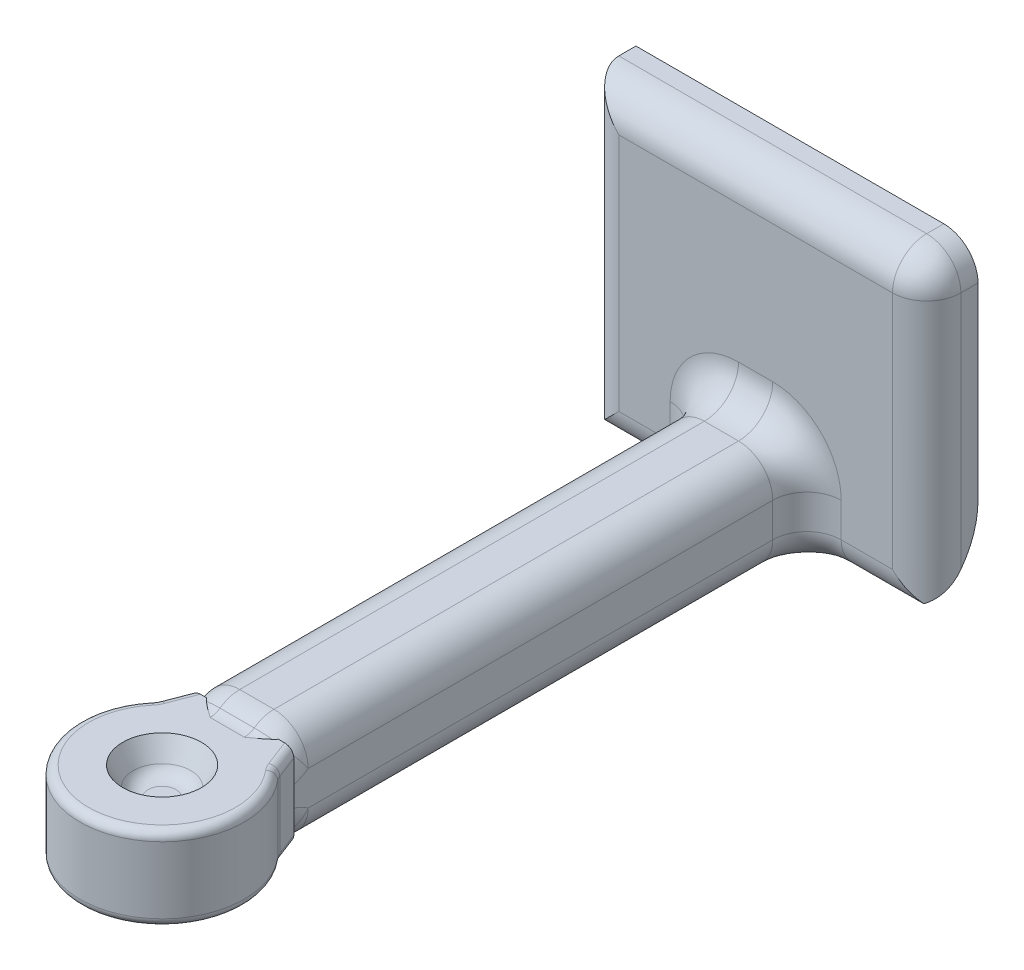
ISO-10303-21;
HEADER;
FILE_DESCRIPTION(('STEP AP214'),'2;1');
FILE_NAME('part.step','',(''),(''),'','','');
FILE_SCHEMA(('AUTOMOTIVE_DESIGN { 1 0 10303 214 1 1 1 1 }'));
ENDSEC;
DATA;
#1=APPLICATION_CONTEXT('core data for automotive mechanical design processes');
#2=APPLICATION_PROTOCOL_DEFINITION('international standard','automotive_design',2000,#1);
#3=PRODUCT_CONTEXT('',#1,'mechanical');
#4=PRODUCT('Part','Part','',(#3));
#5=PRODUCT_RELATED_PRODUCT_CATEGORY('part','',(#4));
#6=PRODUCT_DEFINITION_FORMATION('','',#4);
#7=PRODUCT_DEFINITION_CONTEXT('part definition',#1,'design');
#8=PRODUCT_DEFINITION('design','',#6,#7);
#9=PRODUCT_DEFINITION_SHAPE('','',#8);
#10=(LENGTH_UNIT() NAMED_UNIT(*) SI_UNIT(.MILLI.,.METRE.));
#11=(NAMED_UNIT(*) PLANE_ANGLE_UNIT() SI_UNIT($,.RADIAN.));
#12=(NAMED_UNIT(*) SI_UNIT($,.STERADIAN.) SOLID_ANGLE_UNIT());
#13=UNCERTAINTY_MEASURE_WITH_UNIT(LENGTH_MEASURE(1.E-05),#10,'distance_accuracy_value','');
#14=(GEOMETRIC_REPRESENTATION_CONTEXT(3) GLOBAL_UNCERTAINTY_ASSIGNED_CONTEXT((#13)) GLOBAL_UNIT_ASSIGNED_CONTEXT((#10,
#11,#12)) REPRESENTATION_CONTEXT('',''));
#15=CARTESIAN_POINT('',(0.,0.,0.));
#16=DIRECTION('',(0.,0.,1.));
#17=DIRECTION('',(1.,0.,0.));
#18=AXIS2_PLACEMENT_3D('',#15,#16,#17);
#19=CARTESIAN_POINT('',(-1.,3.45,30.8930285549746));
#20=DIRECTION('',(1.,0.,0.));
#21=DIRECTION('',(0.,0.,-1.));
#22=AXIS2_PLACEMENT_3D('',#19,#20,#21);
#23=TOROIDAL_SURFACE('',#22,3.,2.);
#24=CARTESIAN_POINT('',(-2.11658076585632,2.45,30.));
#25=CARTESIAN_POINT('',(-2.2240328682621,2.35307588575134,30.));
#26=CARTESIAN_POINT('',(-2.32479562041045,2.24814769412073,30.));
#27=CARTESIAN_POINT('',(-2.51003757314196,2.02323243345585,30.));
#28=CARTESIAN_POINT('',(-2.59436147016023,1.90311790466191,30.));
#29=CARTESIAN_POINT('',(-2.7086045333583,1.70737762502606,30.));
#30=CARTESIAN_POINT('',(-2.74593690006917,1.63603538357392,30.));
#31=CARTESIAN_POINT('',(-2.81355533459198,1.49010445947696,30.));
#32=CARTESIAN_POINT('',(-2.84384484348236,1.41551738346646,30.));
#33=CARTESIAN_POINT('',(-2.89667769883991,1.26406303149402,30.));
#34=CARTESIAN_POINT('',(-2.91925895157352,1.18720899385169,30.));
#35=CARTESIAN_POINT('',(-2.95637416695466,1.03162670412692,30.));
#36=CARTESIAN_POINT('',(-2.97091488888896,0.952900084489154,30.));
#37=CARTESIAN_POINT('',(-2.98745723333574,0.825972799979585,30.));
#38=CARTESIAN_POINT('',(-2.99214656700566,0.778108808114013,30.));
#39=CARTESIAN_POINT('',(-2.99841903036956,0.68216691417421,30.));
#40=CARTESIAN_POINT('',(-3.00000142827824,0.6340889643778,30.));
#41=CARTESIAN_POINT('',(-3.00000000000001,0.585999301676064,30.));
#42=B_SPLINE_CURVE_WITH_KNOTS('',3,(#24,#25,#26,#27,#28,#29,#30,#31,#32,#33,#34,#35,#36,#37,#38,
#39,#40,#41),.UNSPECIFIED.,.F.,.F.,(4,2,2,2,2,2,2,2,4),(0.,0.434424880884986,0.872773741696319,
1.11400166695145,1.35511148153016,1.59501792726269,1.83472238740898,1.97890981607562,
2.12313120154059),.UNSPECIFIED.);
#43=CARTESIAN_POINT('',(-2.37477231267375,2.18627716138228,30.));
#44=VERTEX_POINT('',#43);
#45=CARTESIAN_POINT('',(-3.,0.585999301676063,30.));
#46=VERTEX_POINT('',#45);
#47=EDGE_CURVE('E695',#44,#46,#42,.T.);
#48=ORIENTED_EDGE('',*,*,#47,.F.);
#49=CARTESIAN_POINT('',(-1.,1.,29.1616995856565));
#50=DIRECTION('',(0.,0.577109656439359,-0.816666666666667));
#51=DIRECTION('',(0.,0.816666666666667,0.577109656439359));
#52=AXIS2_PLACEMENT_3D('',#49,#50,#51);
#53=CIRCLE('',#52,2.);
#54=CARTESIAN_POINT('',(-3.,1.,29.1616995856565));
#55=VERTEX_POINT('',#54);
#56=EDGE_CURVE('E809',#55,#44,#53,.T.);
#57=ORIENTED_EDGE('',*,*,#56,.F.);
#58=CARTESIAN_POINT('',(-3.,3.45,30.8930285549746));
#59=DIRECTION('',(1.,0.,0.));
#60=DIRECTION('',(0.,0.,-1.));
#61=AXIS2_PLACEMENT_3D('',#58,#59,#60);
#62=CIRCLE('',#61,3.);
#63=EDGE_CURVE('E623',#46,#55,#62,.T.);
#64=ORIENTED_EDGE('',*,*,#63,.F.);
#65=EDGE_LOOP('',(#48,#57,#64));
#66=FACE_BOUND('',#65,.T.);
#67=ADVANCED_FACE('F97',(#66),#23,.T.);
#68=CARTESIAN_POINT('',(1.,3.45,30.8930285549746));
#69=DIRECTION('',(-1.,0.,0.));
#70=DIRECTION('',(0.,0.,1.));
#71=AXIS2_PLACEMENT_3D('',#68,#69,#70);
#72=TOROIDAL_SURFACE('',#71,3.,2.);
#73=CARTESIAN_POINT('',(1.,1.,29.1616995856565));
#74=DIRECTION('',(0.,0.57710965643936,-0.816666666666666));
#75=DIRECTION('',(0.,0.816666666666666,0.57710965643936));
#76=AXIS2_PLACEMENT_3D('',#73,#74,#75);
#77=CIRCLE('',#76,2.);
#78=CARTESIAN_POINT('',(2.37477231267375,2.18627716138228,30.));
#79=VERTEX_POINT('',#78);
#80=CARTESIAN_POINT('',(3.,1.,29.1616995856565));
#81=VERTEX_POINT('',#80);
#82=EDGE_CURVE('E1812',#79,#81,#77,.T.);
#83=ORIENTED_EDGE('',*,*,#82,.F.);
#84=CARTESIAN_POINT('',(3.,0.585999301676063,30.));
#85=CARTESIAN_POINT('',(3.00000835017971,0.649924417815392,30.));
#86=CARTESIAN_POINT('',(2.99720724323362,0.713836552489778,30.));
#87=CARTESIAN_POINT('',(2.98615253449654,0.841156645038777,30.));
#88=CARTESIAN_POINT('',(2.97790169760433,0.904564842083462,30.));
#89=CARTESIAN_POINT('',(2.95617778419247,1.03009382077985,30.));
#90=CARTESIAN_POINT('',(2.94273575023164,1.09221998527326,30.));
#91=CARTESIAN_POINT('',(2.91085295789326,1.21516591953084,30.));
#92=CARTESIAN_POINT('',(2.89241171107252,1.27598556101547,30.));
#93=CARTESIAN_POINT('',(2.82961430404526,1.45690152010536,30.));
#94=CARTESIAN_POINT('',(2.77794825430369,1.57453297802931,30.));
#95=CARTESIAN_POINT('',(2.65756224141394,1.80089805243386,30.));
#96=CARTESIAN_POINT('',(2.58880707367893,1.90961267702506,30.));
#97=CARTESIAN_POINT('',(2.45446635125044,2.09255957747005,30.));
#98=CARTESIAN_POINT('',(2.39179959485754,2.16896596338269,30.));
#99=CARTESIAN_POINT('',(2.25931468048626,2.3147452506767,30.));
#100=CARTESIAN_POINT('',(2.18952680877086,2.38414563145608,30.));
#101=CARTESIAN_POINT('',(2.11658076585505,2.44999999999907,30.));
#102=B_SPLINE_CURVE_WITH_KNOTS('',3,(#84,#85,#86,#87,#88,#89,#90,#91,#92,#93,#94,#95,#96,#97,
#98,#99,#100,#101),.UNSPECIFIED.,.F.,.F.,(4,2,2,2,2,2,2,2,4),(0.,0.19169414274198,
0.383291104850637,0.573759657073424,0.764246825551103,1.14799762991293,1.53254563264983,
1.82850366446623,2.12325166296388),.UNSPECIFIED.);
#103=CARTESIAN_POINT('',(3.,0.585999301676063,30.));
#104=VERTEX_POINT('',#103);
#105=EDGE_CURVE('E738',#104,#79,#102,.T.);
#106=ORIENTED_EDGE('',*,*,#105,.F.);
#107=CARTESIAN_POINT('',(3.,3.45,30.8930285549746));
#108=DIRECTION('',(-1.,0.,0.));
#109=DIRECTION('',(0.,0.,1.));
#110=AXIS2_PLACEMENT_3D('',#107,#108,#109);
#111=CIRCLE('',#110,3.);
#112=EDGE_CURVE('E637',#81,#104,#111,.T.);
#113=ORIENTED_EDGE('',*,*,#112,.F.);
#114=EDGE_LOOP('',(#83,#106,#113));
#115=FACE_BOUND('',#114,.T.);
#116=ADVANCED_FACE('F734',(#115),#72,.T.);
#117=CARTESIAN_POINT('',(1.,-3.45,30.8930285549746));
#118=DIRECTION('',(-1.,0.,0.));
#119=DIRECTION('',(0.,0.,1.));
#120=AXIS2_PLACEMENT_3D('',#117,#118,#119);
#121=TOROIDAL_SURFACE('',#120,3.,2.);
#122=CARTESIAN_POINT('',(2.11658076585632,-2.45,30.));
#123=CARTESIAN_POINT('',(2.2240328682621,-2.35307588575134,30.));
#124=CARTESIAN_POINT('',(2.32479562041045,-2.24814769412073,30.));
#125=CARTESIAN_POINT('',(2.51003757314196,-2.02323243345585,30.));
#126=CARTESIAN_POINT('',(2.59436147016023,-1.90311790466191,30.));
#127=CARTESIAN_POINT('',(2.7086045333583,-1.70737762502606,30.));
#128=CARTESIAN_POINT('',(2.74593690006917,-1.63603538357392,30.));
#129=CARTESIAN_POINT('',(2.81355533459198,-1.49010445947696,30.));
#130=CARTESIAN_POINT('',(2.84384484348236,-1.41551738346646,30.));
#131=CARTESIAN_POINT('',(2.89667769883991,-1.26406303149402,30.));
#132=CARTESIAN_POINT('',(2.91925895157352,-1.18720899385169,30.));
#133=CARTESIAN_POINT('',(2.95637416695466,-1.03162670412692,30.));
#134=CARTESIAN_POINT('',(2.97091488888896,-0.952900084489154,30.));
#135=CARTESIAN_POINT('',(2.98745723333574,-0.825972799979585,30.));
#136=CARTESIAN_POINT('',(2.99214656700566,-0.778108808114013,30.));
#137=CARTESIAN_POINT('',(2.99841903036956,-0.68216691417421,30.));
#138=CARTESIAN_POINT('',(3.00000142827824,-0.634088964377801,30.));
#139=CARTESIAN_POINT('',(3.00000000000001,-0.585999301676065,30.));
#140=B_SPLINE_CURVE_WITH_KNOTS('',3,(#122,#123,#124,#125,#126,#127,#128,#129,#130,#131,#132,
#133,#134,#135,#136,#137,#138,#139),.UNSPECIFIED.,.F.,.F.,(4,2,2,2,2,2,2,2,4),(0.,
0.434424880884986,0.872773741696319,1.11400166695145,1.35511148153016,1.59501792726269,
1.83472238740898,1.97890981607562,2.12313120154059),.UNSPECIFIED.);
#141=CARTESIAN_POINT('',(2.37477231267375,-2.18627716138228,30.));
#142=VERTEX_POINT('',#141);
#143=CARTESIAN_POINT('',(3.,-0.585999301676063,30.));
#144=VERTEX_POINT('',#143);
#145=EDGE_CURVE('E769',#142,#144,#140,.T.);
#146=ORIENTED_EDGE('',*,*,#145,.F.);
#147=CARTESIAN_POINT('',(1.,-1.,29.1616995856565));
#148=DIRECTION('',(0.,-0.577109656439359,-0.816666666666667));
#149=DIRECTION('',(0.,0.816666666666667,-0.577109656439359));
#150=AXIS2_PLACEMENT_3D('',#147,#148,#149);
#151=CIRCLE('',#150,2.);
#152=CARTESIAN_POINT('',(3.,-1.,29.1616995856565));
#153=VERTEX_POINT('',#152);
#154=EDGE_CURVE('E1824',#153,#142,#151,.T.);
#155=ORIENTED_EDGE('',*,*,#154,.F.);
#156=CARTESIAN_POINT('',(3.,-3.45,30.8930285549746));
#157=DIRECTION('',(-1.,0.,0.));
#158=DIRECTION('',(0.,0.,1.));
#159=AXIS2_PLACEMENT_3D('',#156,#157,#158);
#160=CIRCLE('',#159,3.);
#161=EDGE_CURVE('E640',#144,#153,#160,.T.);
#162=ORIENTED_EDGE('',*,*,#161,.F.);
#163=EDGE_LOOP('',(#146,#155,#162));
#164=FACE_BOUND('',#163,.T.);
#165=ADVANCED_FACE('F787',(#164),#121,.T.);
#166=CARTESIAN_POINT('',(-1.,-3.45,30.8930285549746));
#167=DIRECTION('',(1.,0.,0.));
#168=DIRECTION('',(0.,0.,-1.));
#169=AXIS2_PLACEMENT_3D('',#166,#167,#168);
#170=TOROIDAL_SURFACE('',#169,3.,2.);
#171=CARTESIAN_POINT('',(-1.,-1.,29.1616995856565));
#172=DIRECTION('',(0.,-0.57710965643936,-0.816666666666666));
#173=DIRECTION('',(0.,0.816666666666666,-0.57710965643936));
#174=AXIS2_PLACEMENT_3D('',#171,#172,#173);
#175=CIRCLE('',#174,2.);
#176=CARTESIAN_POINT('',(-2.37477231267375,-2.18627716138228,30.));
#177=VERTEX_POINT('',#176);
#178=CARTESIAN_POINT('',(-3.,-1.,29.1616995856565));
#179=VERTEX_POINT('',#178);
#180=EDGE_CURVE('E711',#177,#179,#175,.T.);
#181=ORIENTED_EDGE('',*,*,#180,.F.);
#182=CARTESIAN_POINT('',(-3.,-0.585999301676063,30.));
#183=CARTESIAN_POINT('',(-3.00000835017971,-0.649924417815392,30.));
#184=CARTESIAN_POINT('',(-2.99720724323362,-0.713836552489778,30.));
#185=CARTESIAN_POINT('',(-2.98615253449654,-0.841156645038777,30.));
#186=CARTESIAN_POINT('',(-2.97790169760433,-0.904564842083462,30.));
#187=CARTESIAN_POINT('',(-2.95617778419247,-1.03009382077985,30.));
#188=CARTESIAN_POINT('',(-2.94273575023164,-1.09221998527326,30.));
#189=CARTESIAN_POINT('',(-2.91085295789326,-1.21516591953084,30.));
#190=CARTESIAN_POINT('',(-2.89241171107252,-1.27598556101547,30.));
#191=CARTESIAN_POINT('',(-2.82961430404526,-1.45690152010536,30.));
#192=CARTESIAN_POINT('',(-2.77794825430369,-1.57453297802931,30.));
#193=CARTESIAN_POINT('',(-2.65756224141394,-1.80089805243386,30.));
#194=CARTESIAN_POINT('',(-2.58880707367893,-1.90961267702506,30.));
#195=CARTESIAN_POINT('',(-2.45446635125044,-2.09255957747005,30.));
#196=CARTESIAN_POINT('',(-2.39179959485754,-2.16896596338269,30.));
#197=CARTESIAN_POINT('',(-2.25931468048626,-2.31474525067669,30.));
#198=CARTESIAN_POINT('',(-2.18952680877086,-2.38414563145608,30.));
#199=CARTESIAN_POINT('',(-2.11658076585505,-2.44999999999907,30.));
#200=B_SPLINE_CURVE_WITH_KNOTS('',3,(#182,#183,#184,#185,#186,#187,#188,#189,#190,#191,#192,
#193,#194,#195,#196,#197,#198,#199),.UNSPECIFIED.,.F.,.F.,(4,2,2,2,2,2,2,2,4),(0.,
0.191694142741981,0.383291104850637,0.573759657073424,0.764246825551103,1.14799762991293,
1.53254563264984,1.82850366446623,2.12325166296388),.UNSPECIFIED.);
#201=CARTESIAN_POINT('',(-3.,-0.585999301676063,30.));
#202=VERTEX_POINT('',#201);
#203=EDGE_CURVE('E662',#202,#177,#200,.T.);
#204=ORIENTED_EDGE('',*,*,#203,.F.);
#205=CARTESIAN_POINT('',(-3.,-3.45,30.8930285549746));
#206=DIRECTION('',(1.,0.,0.));
#207=DIRECTION('',(0.,0.,-1.));
#208=AXIS2_PLACEMENT_3D('',#205,#206,#207);
#209=CIRCLE('',#208,3.);
#210=EDGE_CURVE('E626',#179,#202,#209,.T.);
#211=ORIENTED_EDGE('',*,*,#210,.F.);
#212=EDGE_LOOP('',(#181,#204,#211));
#213=FACE_BOUND('',#212,.T.);
#214=ADVANCED_FACE('F798',(#213),#170,.T.);
#215=CARTESIAN_POINT('',(0.,0.,0.));
#216=DIRECTION('',(0.,0.,-1.));
#217=DIRECTION('',(-1.,0.,0.));
#218=AXIS2_PLACEMENT_3D('',#215,#216,#217);
#219=PLANE('',#218);
#220=CARTESIAN_POINT('',(-1.,1.,0.));
#221=DIRECTION('',(0.,0.,-1.));
#222=DIRECTION('',(-1.,0.,0.));
#223=AXIS2_PLACEMENT_3D('',#220,#221,#222);
#224=CIRCLE('',#223,4.);
#225=CARTESIAN_POINT('',(-1.,5.,0.));
#226=VERTEX_POINT('',#225);
#227=CARTESIAN_POINT('',(-5.,1.,0.));
#228=VERTEX_POINT('',#227);
#229=EDGE_CURVE('E462',#226,#228,#224,.F.);
#230=ORIENTED_EDGE('',*,*,#229,.F.);
#231=DIRECTION('',(-1.,0.,0.));
#232=VECTOR('',#231,1.);
#233=CARTESIAN_POINT('',(3.,5.,0.));
#234=LINE('',#233,#232);
#235=CARTESIAN_POINT('',(1.,5.,0.));
#236=VERTEX_POINT('',#235);
#237=EDGE_CURVE('E460',#226,#236,#234,.F.);
#238=ORIENTED_EDGE('',*,*,#237,.T.);
#239=CARTESIAN_POINT('',(1.,1.,0.));
#240=DIRECTION('',(0.,0.,-1.));
#241=DIRECTION('',(-1.,0.,0.));
#242=AXIS2_PLACEMENT_3D('',#239,#240,#241);
#243=CIRCLE('',#242,4.);
#244=CARTESIAN_POINT('',(5.,1.,0.));
#245=VERTEX_POINT('',#244);
#246=EDGE_CURVE('E457',#245,#236,#243,.F.);
#247=ORIENTED_EDGE('',*,*,#246,.F.);
#248=DIRECTION('',(0.,1.,0.));
#249=VECTOR('',#248,1.);
#250=CARTESIAN_POINT('',(5.,-3.,0.));
#251=LINE('',#250,#249);
#252=CARTESIAN_POINT('',(5.,-1.,0.));
#253=VERTEX_POINT('',#252);
#254=EDGE_CURVE('E452',#245,#253,#251,.F.);
#255=ORIENTED_EDGE('',*,*,#254,.T.);
#256=DIRECTION('',(-1.,0.,0.));
#257=VECTOR('',#256,1.);
#258=CARTESIAN_POINT('',(0.,-1.,0.));
#259=LINE('',#258,#257);
#260=CARTESIAN_POINT('',(8.,-1.,0.));
#261=VERTEX_POINT('',#260);
#262=EDGE_CURVE('E449',#253,#261,#259,.F.);
#263=ORIENTED_EDGE('',*,*,#262,.T.);
#264=DIRECTION('',(0.,1.,0.));
#265=VECTOR('',#264,1.);
#266=CARTESIAN_POINT('',(8.,15.,0.));
#267=LINE('',#266,#265);
#268=CARTESIAN_POINT('',(8.,13.,0.));
#269=VERTEX_POINT('',#268);
#270=EDGE_CURVE('E441',#261,#269,#267,.T.);
#271=ORIENTED_EDGE('',*,*,#270,.T.);
#272=DIRECTION('',(-1.,0.,0.));
#273=VECTOR('',#272,1.);
#274=CARTESIAN_POINT('',(-10.,13.,0.));
#275=LINE('',#274,#273);
#276=CARTESIAN_POINT('',(-8.,13.,0.));
#277=VERTEX_POINT('',#276);
#278=EDGE_CURVE('E439',#269,#277,#275,.T.);
#279=ORIENTED_EDGE('',*,*,#278,.T.);
#280=DIRECTION('',(0.,1.,0.));
#281=VECTOR('',#280,1.);
#282=CARTESIAN_POINT('',(-8.,0.,0.));
#283=LINE('',#282,#281);
#284=CARTESIAN_POINT('',(-8.,-1.,0.));
#285=VERTEX_POINT('',#284);
#286=EDGE_CURVE('E443',#277,#285,#283,.F.);
#287=ORIENTED_EDGE('',*,*,#286,.T.);
#288=DIRECTION('',(-1.,0.,0.));
#289=VECTOR('',#288,1.);
#290=CARTESIAN_POINT('',(0.,-1.,0.));
#291=LINE('',#290,#289);
#292=CARTESIAN_POINT('',(-5.,-1.,0.));
#293=VERTEX_POINT('',#292);
#294=EDGE_CURVE('E446',#285,#293,#291,.F.);
#295=ORIENTED_EDGE('',*,*,#294,.T.);
#296=DIRECTION('',(0.,-1.,0.));
#297=VECTOR('',#296,1.);
#298=CARTESIAN_POINT('',(-5.,3.,0.));
#299=LINE('',#298,#297);
#300=EDGE_CURVE('E455',#293,#228,#299,.F.);
#301=ORIENTED_EDGE('',*,*,#300,.T.);
#302=EDGE_LOOP('',(#230,#238,#247,#255,#263,#271,#279,#287,#295,#301));
#303=FACE_BOUND('',#302,.T.);
#304=ADVANCED_FACE('F968',(#303),#219,.F.);
#305=CARTESIAN_POINT('',(3.,-3.,30.));
#306=DIRECTION('',(-1.,0.,0.));
#307=DIRECTION('',(0.,0.,1.));
#308=AXIS2_PLACEMENT_3D('',#305,#306,#307);
#309=PLANE('',#308);
#310=DIRECTION('',(0.,1.,0.));
#311=VECTOR('',#310,1.);
#312=CARTESIAN_POINT('',(3.,-3.,30.));
#313=LINE('',#312,#311);
#314=EDGE_CURVE('E404',#144,#104,#313,.T.);
#315=ORIENTED_EDGE('',*,*,#314,.F.);
#316=ORIENTED_EDGE('',*,*,#161,.T.);
#317=DIRECTION('',(0.,0.,-1.));
#318=VECTOR('',#317,1.);
#319=CARTESIAN_POINT('',(3.,-1.,30.));
#320=LINE('',#319,#318);
#321=CARTESIAN_POINT('',(3.,-1.,2.));
#322=VERTEX_POINT('',#321);
#323=EDGE_CURVE('E417',#153,#322,#320,.T.);
#324=ORIENTED_EDGE('',*,*,#323,.T.);
#325=DIRECTION('',(0.,1.,0.));
#326=VECTOR('',#325,1.);
#327=CARTESIAN_POINT('',(3.,3.,2.));
#328=LINE('',#327,#326);
#329=CARTESIAN_POINT('',(3.,1.,2.));
#330=VERTEX_POINT('',#329);
#331=EDGE_CURVE('E412',#322,#330,#328,.T.);
#332=ORIENTED_EDGE('',*,*,#331,.T.);
#333=DIRECTION('',(0.,0.,-1.));
#334=VECTOR('',#333,1.);
#335=CARTESIAN_POINT('',(3.,1.,30.));
#336=LINE('',#335,#334);
#337=EDGE_CURVE('E414',#330,#81,#336,.F.);
#338=ORIENTED_EDGE('',*,*,#337,.T.);
#339=ORIENTED_EDGE('',*,*,#112,.T.);
#340=EDGE_LOOP('',(#315,#316,#324,#332,#338,#339));
#341=FACE_BOUND('',#340,.T.);
#342=ADVANCED_FACE('F994',(#341),#309,.F.);
#343=CARTESIAN_POINT('',(-3.,3.,30.));
#344=DIRECTION('',(0.,-1.,0.));
#345=DIRECTION('',(0.,0.,-1.));
#346=AXIS2_PLACEMENT_3D('',#343,#344,#345);
#347=PLANE('',#346);
#348=DIRECTION('',(0.,0.,-1.));
#349=VECTOR('',#348,1.);
#350=CARTESIAN_POINT('',(-1.,3.,30.));
#351=LINE('',#350,#349);
#352=CARTESIAN_POINT('',(-1.,3.,2.));
#353=VERTEX_POINT('',#352);
#354=CARTESIAN_POINT('',(-1.,3.,29.1616995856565));
#355=VERTEX_POINT('',#354);
#356=EDGE_CURVE('E436',#353,#355,#351,.F.);
#357=ORIENTED_EDGE('',*,*,#356,.T.);
#358=DIRECTION('',(-1.,0.,0.));
#359=VECTOR('',#358,1.);
#360=CARTESIAN_POINT('',(-3.,3.,29.1616995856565));
#361=LINE('',#360,#359);
#362=CARTESIAN_POINT('',(1.,3.,29.1616995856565));
#363=VERTEX_POINT('',#362);
#364=EDGE_CURVE('E660',#355,#363,#361,.F.);
#365=ORIENTED_EDGE('',*,*,#364,.T.);
#366=DIRECTION('',(0.,0.,-1.));
#367=VECTOR('',#366,1.);
#368=CARTESIAN_POINT('',(1.,3.,30.));
#369=LINE('',#368,#367);
#370=CARTESIAN_POINT('',(1.,3.,2.));
#371=VERTEX_POINT('',#370);
#372=EDGE_CURVE('E434',#363,#371,#369,.T.);
#373=ORIENTED_EDGE('',*,*,#372,.T.);
#374=DIRECTION('',(-1.,0.,0.));
#375=VECTOR('',#374,1.);
#376=CARTESIAN_POINT('',(-3.,3.,2.));
#377=LINE('',#376,#375);
#378=EDGE_CURVE('E432',#371,#353,#377,.T.);
#379=ORIENTED_EDGE('',*,*,#378,.T.);
#380=EDGE_LOOP('',(#357,#365,#373,#379));
#381=FACE_BOUND('',#380,.T.);
#382=ADVANCED_FACE('F1004',(#381),#347,.F.);
#383=CARTESIAN_POINT('',(-3.,-3.,30.));
#384=DIRECTION('',(1.,0.,0.));
#385=DIRECTION('',(0.,0.,-1.));
#386=AXIS2_PLACEMENT_3D('',#383,#384,#385);
#387=PLANE('',#386);
#388=DIRECTION('',(0.,0.,-1.));
#389=VECTOR('',#388,1.);
#390=CARTESIAN_POINT('',(-3.,-1.,30.));
#391=LINE('',#390,#389);
#392=CARTESIAN_POINT('',(-3.,-1.,2.));
#393=VERTEX_POINT('',#392);
#394=EDGE_CURVE('E429',#393,#179,#391,.F.);
#395=ORIENTED_EDGE('',*,*,#394,.T.);
#396=ORIENTED_EDGE('',*,*,#210,.T.);
#397=DIRECTION('',(0.,-1.,0.));
#398=VECTOR('',#397,1.);
#399=CARTESIAN_POINT('',(-3.,-3.,30.));
#400=LINE('',#399,#398);
#401=EDGE_CURVE('E407',#46,#202,#400,.T.);
#402=ORIENTED_EDGE('',*,*,#401,.F.);
#403=ORIENTED_EDGE('',*,*,#63,.T.);
#404=DIRECTION('',(0.,0.,-1.));
#405=VECTOR('',#404,1.);
#406=CARTESIAN_POINT('',(-3.,1.,30.));
#407=LINE('',#406,#405);
#408=CARTESIAN_POINT('',(-3.,1.,2.));
#409=VERTEX_POINT('',#408);
#410=EDGE_CURVE('E427',#55,#409,#407,.T.);
#411=ORIENTED_EDGE('',*,*,#410,.T.);
#412=DIRECTION('',(0.,-1.,0.));
#413=VECTOR('',#412,1.);
#414=CARTESIAN_POINT('',(-3.,-3.,2.));
#415=LINE('',#414,#413);
#416=EDGE_CURVE('E425',#409,#393,#415,.T.);
#417=ORIENTED_EDGE('',*,*,#416,.T.);
#418=EDGE_LOOP('',(#395,#396,#402,#403,#411,#417));
#419=FACE_BOUND('',#418,.T.);
#420=ADVANCED_FACE('F1011',(#419),#387,.F.);
#421=CARTESIAN_POINT('',(-3.,-3.,30.));
#422=DIRECTION('',(0.,1.,0.));
#423=DIRECTION('',(0.,0.,1.));
#424=AXIS2_PLACEMENT_3D('',#421,#422,#423);
#425=PLANE('',#424);
#426=DIRECTION('',(0.,0.,-1.));
#427=VECTOR('',#426,1.);
#428=CARTESIAN_POINT('',(-1.,-3.,30.));
#429=LINE('',#428,#427);
#430=CARTESIAN_POINT('',(-1.,-3.,29.1616995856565));
#431=VERTEX_POINT('',#430);
#432=CARTESIAN_POINT('',(-1.,-3.,2.));
#433=VERTEX_POINT('',#432);
#434=EDGE_CURVE('E419',#431,#433,#429,.T.);
#435=ORIENTED_EDGE('',*,*,#434,.T.);
#436=DIRECTION('',(-1.,0.,0.));
#437=VECTOR('',#436,1.);
#438=CARTESIAN_POINT('',(10.,-3.,2.));
#439=LINE('',#438,#437);
#440=CARTESIAN_POINT('',(1.,-3.,2.));
#441=VERTEX_POINT('',#440);
#442=EDGE_CURVE('E902',#433,#441,#439,.F.);
#443=ORIENTED_EDGE('',*,*,#442,.T.);
#444=DIRECTION('',(0.,0.,-1.));
#445=VECTOR('',#444,1.);
#446=CARTESIAN_POINT('',(1.,-3.,30.));
#447=LINE('',#446,#445);
#448=CARTESIAN_POINT('',(1.,-3.,29.1616995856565));
#449=VERTEX_POINT('',#448);
#450=EDGE_CURVE('E422',#441,#449,#447,.F.);
#451=ORIENTED_EDGE('',*,*,#450,.T.);
#452=DIRECTION('',(1.,0.,0.));
#453=VECTOR('',#452,1.);
#454=CARTESIAN_POINT('',(-3.,-3.,29.1616995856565));
#455=LINE('',#454,#453);
#456=EDGE_CURVE('E658',#449,#431,#455,.F.);
#457=ORIENTED_EDGE('',*,*,#456,.T.);
#458=EDGE_LOOP('',(#435,#443,#451,#457));
#459=FACE_BOUND('',#458,.T.);
#460=ADVANCED_FACE('F979',(#459),#425,.F.);
#461=CARTESIAN_POINT('',(10.,0.,-3.));
#462=DIRECTION('',(1.,0.,0.));
#463=DIRECTION('',(0.,0.,-1.));
#464=AXIS2_PLACEMENT_3D('',#461,#462,#463);
#465=PLANE('',#464);
#466=DIRECTION('',(0.,1.,0.));
#467=VECTOR('',#466,1.);
#468=CARTESIAN_POINT('',(10.,-3.,-2.));
#469=LINE('',#468,#467);
#470=CARTESIAN_POINT('',(10.,13.,-2.));
#471=VERTEX_POINT('',#470);
#472=CARTESIAN_POINT('',(10.,-1.,-2.));
#473=VERTEX_POINT('',#472);
#474=EDGE_CURVE('E468',#471,#473,#469,.F.);
#475=ORIENTED_EDGE('',*,*,#474,.T.);
#476=CARTESIAN_POINT('',(10.,2.,2.));
#477=DIRECTION('',(1.,0.,0.));
#478=DIRECTION('',(0.,0.,-1.));
#479=AXIS2_PLACEMENT_3D('',#476,#477,#478);
#480=CIRCLE('',#479,5.);
#481=CARTESIAN_POINT('',(10.,2.,-3.));
#482=VERTEX_POINT('',#481);
#483=EDGE_CURVE('E12',#473,#482,#480,.T.);
#484=ORIENTED_EDGE('',*,*,#483,.T.);
#485=DIRECTION('',(0.,1.,0.));
#486=VECTOR('',#485,1.);
#487=CARTESIAN_POINT('',(10.,0.,-3.));
#488=LINE('',#487,#486);
#489=CARTESIAN_POINT('',(10.,13.,-3.));
#490=VERTEX_POINT('',#489);
#491=EDGE_CURVE('E391',#482,#490,#488,.T.);
#492=ORIENTED_EDGE('',*,*,#491,.T.);
#493=DIRECTION('',(0.,0.,1.));
#494=VECTOR('',#493,1.);
#495=CARTESIAN_POINT('',(10.,13.,-3.));
#496=LINE('',#495,#494);
#497=EDGE_CURVE('E466',#490,#471,#496,.T.);
#498=ORIENTED_EDGE('',*,*,#497,.T.);
#499=EDGE_LOOP('',(#475,#484,#492,#498));
#500=FACE_BOUND('',#499,.T.);
#501=ADVANCED_FACE('F1043',(#500),#465,.T.);
#502=CARTESIAN_POINT('',(-10.,0.,-3.));
#503=DIRECTION('',(1.,0.,0.));
#504=DIRECTION('',(0.,0.,-1.));
#505=AXIS2_PLACEMENT_3D('',#502,#503,#504);
#506=PLANE('',#505);
#507=DIRECTION('',(0.,1.,0.));
#508=VECTOR('',#507,1.);
#509=CARTESIAN_POINT('',(-10.,0.,-3.));
#510=LINE('',#509,#508);
#511=CARTESIAN_POINT('',(-10.,2.,-3.));
#512=VERTEX_POINT('',#511);
#513=CARTESIAN_POINT('',(-10.,15.,-3.));
#514=VERTEX_POINT('',#513);
#515=EDGE_CURVE('E380',#512,#514,#510,.T.);
#516=ORIENTED_EDGE('',*,*,#515,.F.);
#517=CARTESIAN_POINT('',(-10.,2.,2.));
#518=DIRECTION('',(1.,0.,0.));
#519=DIRECTION('',(0.,0.,-1.));
#520=AXIS2_PLACEMENT_3D('',#517,#518,#519);
#521=CIRCLE('',#520,5.);
#522=CARTESIAN_POINT('',(-10.,-1.,-2.));
#523=VERTEX_POINT('',#522);
#524=EDGE_CURVE('E858',#512,#523,#521,.F.);
#525=ORIENTED_EDGE('',*,*,#524,.T.);
#526=DIRECTION('',(0.,1.,0.));
#527=VECTOR('',#526,1.);
#528=CARTESIAN_POINT('',(-10.,0.,-2.));
#529=LINE('',#528,#527);
#530=CARTESIAN_POINT('',(-10.,15.,-2.));
#531=VERTEX_POINT('',#530);
#532=EDGE_CURVE('E403',#523,#531,#529,.T.);
#533=ORIENTED_EDGE('',*,*,#532,.T.);
#534=DIRECTION('',(0.,0.,1.));
#535=VECTOR('',#534,1.);
#536=CARTESIAN_POINT('',(-10.,15.,-3.));
#537=LINE('',#536,#535);
#538=EDGE_CURVE('E396',#514,#531,#537,.T.);
#539=ORIENTED_EDGE('',*,*,#538,.F.);
#540=EDGE_LOOP('',(#516,#525,#533,#539));
#541=FACE_BOUND('',#540,.T.);
#542=ADVANCED_FACE('F401',(#541),#506,.F.);
#543=CARTESIAN_POINT('',(0.,15.,-3.));
#544=DIRECTION('',(0.,1.,0.));
#545=DIRECTION('',(0.,0.,1.));
#546=AXIS2_PLACEMENT_3D('',#543,#544,#545);
#547=PLANE('',#546);
#548=DIRECTION('',(-1.,0.,0.));
#549=VECTOR('',#548,1.);
#550=CARTESIAN_POINT('',(10.,15.,-2.));
#551=LINE('',#550,#549);
#552=CARTESIAN_POINT('',(8.,15.,-2.));
#553=VERTEX_POINT('',#552);
#554=EDGE_CURVE('E470',#531,#553,#551,.F.);
#555=ORIENTED_EDGE('',*,*,#554,.T.);
#556=DIRECTION('',(0.,0.,1.));
#557=VECTOR('',#556,1.);
#558=CARTESIAN_POINT('',(8.,15.,-3.));
#559=LINE('',#558,#557);
#560=CARTESIAN_POINT('',(8.,15.,-3.));
#561=VERTEX_POINT('',#560);
#562=EDGE_CURVE('E399',#553,#561,#559,.F.);
#563=ORIENTED_EDGE('',*,*,#562,.T.);
#564=DIRECTION('',(-1.,0.,0.));
#565=VECTOR('',#564,1.);
#566=CARTESIAN_POINT('',(0.,15.,-3.));
#567=LINE('',#566,#565);
#568=EDGE_CURVE('E385',#561,#514,#567,.T.);
#569=ORIENTED_EDGE('',*,*,#568,.T.);
#570=ORIENTED_EDGE('',*,*,#538,.T.);
#571=EDGE_LOOP('',(#555,#563,#569,#570));
#572=FACE_BOUND('',#571,.T.);
#573=ADVANCED_FACE('F395',(#572),#547,.T.);
#574=CARTESIAN_POINT('',(0.,0.,-3.));
#575=DIRECTION('',(0.,0.,-1.));
#576=DIRECTION('',(-1.,0.,0.));
#577=AXIS2_PLACEMENT_3D('',#574,#575,#576);
#578=PLANE('',#577);
#579=ORIENTED_EDGE('',*,*,#491,.F.);
#580=DIRECTION('',(-1.,0.,0.));
#581=VECTOR('',#580,1.);
#582=CARTESIAN_POINT('',(-10.,2.,-3.));
#583=LINE('',#582,#581);
#584=EDGE_CURVE('E388',#482,#512,#583,.T.);
#585=ORIENTED_EDGE('',*,*,#584,.T.);
#586=ORIENTED_EDGE('',*,*,#515,.T.);
#587=ORIENTED_EDGE('',*,*,#568,.F.);
#588=CARTESIAN_POINT('',(8.,13.,-3.));
#589=DIRECTION('',(0.,0.,-1.));
#590=DIRECTION('',(-1.,0.,0.));
#591=AXIS2_PLACEMENT_3D('',#588,#589,#590);
#592=CIRCLE('',#591,2.);
#593=EDGE_CURVE('E473',#561,#490,#592,.T.);
#594=ORIENTED_EDGE('',*,*,#593,.T.);
#595=EDGE_LOOP('',(#579,#585,#586,#587,#594));
#596=FACE_BOUND('',#595,.T.);
#597=ADVANCED_FACE('F383',(#596),#578,.T.);
#598=CARTESIAN_POINT('',(-1.,-1.,30.));
#599=DIRECTION('',(0.,0.,-1.));
#600=DIRECTION('',(-1.,0.,0.));
#601=AXIS2_PLACEMENT_3D('',#598,#599,#600);
#602=CYLINDRICAL_SURFACE('',#601,2.);
#603=ORIENTED_EDGE('',*,*,#434,.F.);
#604=CARTESIAN_POINT('',(-1.,-1.,29.1616995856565));
#605=DIRECTION('',(0.,0.,-1.));
#606=DIRECTION('',(-1.,0.,0.));
#607=AXIS2_PLACEMENT_3D('',#604,#605,#606);
#608=CIRCLE('',#607,2.);
#609=EDGE_CURVE('E594',#431,#179,#608,.T.);
#610=ORIENTED_EDGE('',*,*,#609,.T.);
#611=ORIENTED_EDGE('',*,*,#394,.F.);
#612=CARTESIAN_POINT('',(-1.,-1.,2.));
#613=DIRECTION('',(0.,0.,-1.));
#614=DIRECTION('',(-1.,0.,0.));
#615=AXIS2_PLACEMENT_3D('',#612,#613,#614);
#616=CIRCLE('',#615,2.);
#617=EDGE_CURVE('E524',#433,#393,#616,.T.);
#618=ORIENTED_EDGE('',*,*,#617,.F.);
#619=EDGE_LOOP('',(#603,#610,#611,#618));
#620=FACE_BOUND('',#619,.T.);
#621=ADVANCED_FACE('F893',(#620),#602,.T.);
#622=CARTESIAN_POINT('',(-5.,-1.,2.));
#623=DIRECTION('',(0.,1.,0.));
#624=DIRECTION('',(0.,0.,1.));
#625=AXIS2_PLACEMENT_3D('',#622,#623,#624);
#626=TOROIDAL_SURFACE('',#625,4.,2.);
#627=CARTESIAN_POINT('',(-5.,-1.,-2.));
#628=DIRECTION('',(1.,0.,0.));
#629=DIRECTION('',(0.,0.,-1.));
#630=AXIS2_PLACEMENT_3D('',#627,#628,#629);
#631=CIRCLE('',#630,2.);
#632=CARTESIAN_POINT('',(-5.,-2.32767343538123,-0.504244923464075));
#633=VERTEX_POINT('',#632);
#634=EDGE_CURVE('E522',#633,#293,#631,.F.);
#635=ORIENTED_EDGE('',*,*,#634,.F.);
#636=CARTESIAN_POINT('',(-5.,-2.32767343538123,-0.504244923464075));
#637=CARTESIAN_POINT('',(-4.91499301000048,-2.32764810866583,-0.504262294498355));
#638=CARTESIAN_POINT('',(-4.82999916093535,-2.32932747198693,-0.50138602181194));
#639=CARTESIAN_POINT('',(-4.66058478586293,-2.33590549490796,-0.489980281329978));
#640=CARTESIAN_POINT('',(-4.57616384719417,-2.34080151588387,-0.481455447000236));
#641=CARTESIAN_POINT('',(-4.40899095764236,-2.35357068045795,-0.458978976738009));
#642=CARTESIAN_POINT('',(-4.32623099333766,-2.36141903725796,-0.445072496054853));
#643=CARTESIAN_POINT('',(-4.16204051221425,-2.37976689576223,-0.412053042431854));
#644=CARTESIAN_POINT('',(-4.08061040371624,-2.39026719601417,-0.392938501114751));
#645=CARTESIAN_POINT('',(-3.88437057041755,-2.41858050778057,-0.340381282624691));
#646=CARTESIAN_POINT('',(-3.77042774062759,-2.43758867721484,-0.304321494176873));
#647=CARTESIAN_POINT('',(-3.54650632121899,-2.47895256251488,-0.22285116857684));
#648=CARTESIAN_POINT('',(-3.43653096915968,-2.50131093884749,-0.177433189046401));
#649=CARTESIAN_POINT('',(-3.22040669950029,-2.54814814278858,-0.0778330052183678));
#650=CARTESIAN_POINT('',(-3.11428012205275,-2.57263718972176,-0.0236073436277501));
#651=CARTESIAN_POINT('',(-2.90665712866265,-2.62234404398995,0.0926634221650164));
#652=CARTESIAN_POINT('',(-2.80515909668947,-2.64756159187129,0.154705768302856));
#653=CARTESIAN_POINT('',(-2.58135192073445,-2.70397410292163,0.302823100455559));
#654=CARTESIAN_POINT('',(-2.46038520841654,-2.73504255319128,0.390979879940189));
#655=CARTESIAN_POINT('',(-2.22584140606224,-2.79439048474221,0.577534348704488));
#656=CARTESIAN_POINT('',(-2.11226712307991,-2.82266890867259,0.675935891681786));
#657=CARTESIAN_POINT('',(-1.89298384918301,-2.8744776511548,0.881657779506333));
#658=CARTESIAN_POINT('',(-1.78725297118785,-2.89802152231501,0.988951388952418));
#659=CARTESIAN_POINT('',(-1.5835646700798,-2.93876456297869,1.21170441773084));
#660=CARTESIAN_POINT('',(-1.48560189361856,-2.95596813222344,1.32715810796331));
#661=CARTESIAN_POINT('',(-1.33823441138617,-2.97678880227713,1.51396643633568));
#662=CARTESIAN_POINT('',(-1.28609178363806,-2.98306616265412,1.58289187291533));
#663=CARTESIAN_POINT('',(-1.18452851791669,-2.99280587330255,1.72286240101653));
#664=CARTESIAN_POINT('',(-1.13510623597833,-2.99626994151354,1.79390617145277));
#665=CARTESIAN_POINT('',(-1.06013647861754,-2.99928610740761,1.90633200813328));
#666=CARTESIAN_POINT('',(-1.03362862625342,-2.9998877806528,1.94705072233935));
#667=CARTESIAN_POINT('',(-1.00504377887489,-2.99999523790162,1.99203449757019));
#668=CARTESIAN_POINT('',(-1.0025197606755,-2.99999999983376,1.99601590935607));
#669=CARTESIAN_POINT('',(-1.,-3.,2.));
#670=B_SPLINE_CURVE_WITH_KNOTS('',3,(#636,#637,#638,#639,#640,#641,#642,#643,#644,#645,#646,
#647,#648,#649,#650,#651,#652,#653,#654,#655,#656,#657,#658,#659,#660,#661,#662,#663,#664,#665,
#666,#667,#668,#669),.UNSPECIFIED.,.F.,.F.,(4,2,2,2,2,2,2,2,2,2,2,2,2,2,2,2,4),(0.,
0.254934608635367,0.509660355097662,0.76229358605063,1.01500298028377,1.37749518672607,
1.74027679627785,2.10490601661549,2.46940693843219,2.92743380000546,3.38563358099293,
3.84250249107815,4.29905376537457,4.55892126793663,4.81862996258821,4.96438043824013,
4.97852258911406),.UNSPECIFIED.);
#671=EDGE_CURVE('E896',#633,#433,#670,.T.);
#672=ORIENTED_EDGE('',*,*,#671,.T.);
#673=ORIENTED_EDGE('',*,*,#617,.T.);
#674=CARTESIAN_POINT('',(-5.,-1.,2.));
#675=DIRECTION('',(0.,1.,0.));
#676=DIRECTION('',(0.,0.,1.));
#677=AXIS2_PLACEMENT_3D('',#674,#675,#676);
#678=CIRCLE('',#677,2.);
#679=EDGE_CURVE('E519',#293,#393,#678,.F.);
#680=ORIENTED_EDGE('',*,*,#679,.F.);
#681=EDGE_LOOP('',(#635,#672,#673,#680));
#682=FACE_BOUND('',#681,.T.);
#683=ADVANCED_FACE('F888',(#682),#626,.T.);
#684=CARTESIAN_POINT('',(-3.,-1.,-2.));
#685=DIRECTION('',(-1.,0.,0.));
#686=DIRECTION('',(0.,0.,1.));
#687=AXIS2_PLACEMENT_3D('',#684,#685,#686);
#688=CYLINDRICAL_SURFACE('',#687,2.);
#689=CARTESIAN_POINT('',(-8.,-1.,-2.));
#690=DIRECTION('',(-0.707106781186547,0.707106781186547,0.));
#691=DIRECTION('',(0.707106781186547,0.707106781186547,0.));
#692=AXIS2_PLACEMENT_3D('',#689,#690,#691);
#693=ELLIPSE('',#692,2.82842712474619,2.);
#694=CARTESIAN_POINT('',(-9.32767343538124,-2.32767343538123,-0.504244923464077));
#695=VERTEX_POINT('',#694);
#696=EDGE_CURVE('E517',#695,#285,#693,.T.);
#697=ORIENTED_EDGE('',*,*,#696,.F.);
#698=DIRECTION('',(1.,0.,0.));
#699=VECTOR('',#698,1.);
#700=CARTESIAN_POINT('',(-9.32767343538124,-2.32767343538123,-0.504244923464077));
#701=LINE('',#700,#699);
#702=EDGE_CURVE('E867',#695,#633,#701,.T.);
#703=ORIENTED_EDGE('',*,*,#702,.T.);
#704=ORIENTED_EDGE('',*,*,#634,.T.);
#705=ORIENTED_EDGE('',*,*,#294,.F.);
#706=EDGE_LOOP('',(#697,#703,#704,#705));
#707=FACE_BOUND('',#706,.T.);
#708=ADVANCED_FACE('F884',(#707),#688,.T.);
#709=CARTESIAN_POINT('',(-1.,1.,30.));
#710=DIRECTION('',(0.,0.,-1.));
#711=DIRECTION('',(-1.,0.,0.));
#712=AXIS2_PLACEMENT_3D('',#709,#710,#711);
#713=CYLINDRICAL_SURFACE('',#712,2.);
#714=ORIENTED_EDGE('',*,*,#410,.F.);
#715=CARTESIAN_POINT('',(-1.,1.,29.1616995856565));
#716=DIRECTION('',(0.,0.,-1.));
#717=DIRECTION('',(-1.,0.,0.));
#718=AXIS2_PLACEMENT_3D('',#715,#716,#717);
#719=CIRCLE('',#718,2.);
#720=EDGE_CURVE('E656',#55,#355,#719,.T.);
#721=ORIENTED_EDGE('',*,*,#720,.T.);
#722=ORIENTED_EDGE('',*,*,#356,.F.);
#723=CARTESIAN_POINT('',(-1.,1.,2.));
#724=DIRECTION('',(0.,0.,-1.));
#725=DIRECTION('',(-1.,0.,0.));
#726=AXIS2_PLACEMENT_3D('',#723,#724,#725);
#727=CIRCLE('',#726,2.);
#728=EDGE_CURVE('E514',#409,#353,#727,.T.);
#729=ORIENTED_EDGE('',*,*,#728,.F.);
#730=EDGE_LOOP('',(#714,#721,#722,#729));
#731=FACE_BOUND('',#730,.T.);
#732=ADVANCED_FACE('F880',(#731),#713,.T.);
#733=CARTESIAN_POINT('',(-5.,-3.,2.));
#734=DIRECTION('',(0.,1.,0.));
#735=DIRECTION('',(0.,0.,1.));
#736=AXIS2_PLACEMENT_3D('',#733,#734,#735);
#737=CYLINDRICAL_SURFACE('',#736,2.);
#738=ORIENTED_EDGE('',*,*,#679,.T.);
#739=ORIENTED_EDGE('',*,*,#416,.F.);
#740=CARTESIAN_POINT('',(-5.,1.,2.));
#741=DIRECTION('',(0.,-1.,0.));
#742=DIRECTION('',(0.,0.,-1.));
#743=AXIS2_PLACEMENT_3D('',#740,#741,#742);
#744=CIRCLE('',#743,2.);
#745=EDGE_CURVE('E511',#228,#409,#744,.T.);
#746=ORIENTED_EDGE('',*,*,#745,.F.);
#747=ORIENTED_EDGE('',*,*,#300,.F.);
#748=EDGE_LOOP('',(#738,#739,#746,#747));
#749=FACE_BOUND('',#748,.T.);
#750=ADVANCED_FACE('F875',(#749),#737,.F.);
#751=CARTESIAN_POINT('',(-8.,0.,-2.));
#752=DIRECTION('',(0.,1.,0.));
#753=DIRECTION('',(0.,0.,1.));
#754=AXIS2_PLACEMENT_3D('',#751,#752,#753);
#755=CYLINDRICAL_SURFACE('',#754,2.);
#756=ORIENTED_EDGE('',*,*,#532,.F.);
#757=CARTESIAN_POINT('',(-10.,-1.,-2.));
#758=CARTESIAN_POINT('',(-9.9999929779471,-1.06733357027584,-1.94951625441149));
#759=CARTESIAN_POINT('',(-9.99808669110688,-1.1334123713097,-1.8972849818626));
#760=CARTESIAN_POINT('',(-9.98963931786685,-1.26282144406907,-1.78959948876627));
#761=CARTESIAN_POINT('',(-9.9830878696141,-1.32614523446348,-1.73413831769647));
#762=CARTESIAN_POINT('',(-9.96441246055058,-1.45012477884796,-1.61991943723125));
#763=CARTESIAN_POINT('',(-9.95223276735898,-1.51074704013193,-1.56113404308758));
#764=CARTESIAN_POINT('',(-9.92143200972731,-1.62808987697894,-1.44150884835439));
#765=CARTESIAN_POINT('',(-9.902817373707,-1.68481427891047,-1.38067115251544));
#766=CARTESIAN_POINT('',(-9.84870043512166,-1.8174781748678,-1.23119946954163));
#767=CARTESIAN_POINT('',(-9.80937748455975,-1.891164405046,-1.14188471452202));
#768=CARTESIAN_POINT('',(-9.71413296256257,-2.02774658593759,-0.964738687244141));
#769=CARTESIAN_POINT('',(-9.65832057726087,-2.09070934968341,-0.87690155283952));
#770=CARTESIAN_POINT('',(-9.55562441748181,-2.18191204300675,-0.741411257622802));
#771=CARTESIAN_POINT('',(-9.51434643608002,-2.21385694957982,-0.69194861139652));
#772=CARTESIAN_POINT('',(-9.42560550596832,-2.27380742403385,-0.59573081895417));
#773=CARTESIAN_POINT('',(-9.37811194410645,-2.3017919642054,-0.548990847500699));
#774=CARTESIAN_POINT('',(-9.32767343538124,-2.32767343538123,-0.504244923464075));
#775=B_SPLINE_CURVE_WITH_KNOTS('',3,(#757,#758,#759,#760,#761,#762,#763,#764,#765,#766,#767,
#768,#769,#770,#771,#772,#773,#774),.UNSPECIFIED.,.F.,.F.,(4,2,2,2,2,2,2,2,4),(0.,
0.252489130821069,0.505543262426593,0.761158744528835,1.01651960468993,1.3819219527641,
1.74495700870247,1.96029178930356,2.17673013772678),.UNSPECIFIED.);
#776=EDGE_CURVE('E860',#523,#695,#775,.T.);
#777=ORIENTED_EDGE('',*,*,#776,.T.);
#778=ORIENTED_EDGE('',*,*,#696,.T.);
#779=ORIENTED_EDGE('',*,*,#286,.F.);
#780=CARTESIAN_POINT('',(-8.,13.,-2.));
#781=DIRECTION('',(0.707106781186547,0.707106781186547,0.));
#782=DIRECTION('',(0.707106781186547,-0.707106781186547,0.));
#783=AXIS2_PLACEMENT_3D('',#780,#781,#782);
#784=ELLIPSE('',#783,2.82842712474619,2.);
#785=EDGE_CURVE('E508',#531,#277,#784,.T.);
#786=ORIENTED_EDGE('',*,*,#785,.F.);
#787=EDGE_LOOP('',(#756,#777,#778,#779,#786));
#788=FACE_BOUND('',#787,.T.);
#789=ADVANCED_FACE('F869',(#788),#755,.T.);
#790=CARTESIAN_POINT('',(-1.,1.,2.));
#791=DIRECTION('',(0.,0.,-1.));
#792=DIRECTION('',(-1.,0.,0.));
#793=AXIS2_PLACEMENT_3D('',#790,#791,#792);
#794=TOROIDAL_SURFACE('',#793,4.,2.);
#795=ORIENTED_EDGE('',*,*,#745,.T.);
#796=ORIENTED_EDGE('',*,*,#728,.T.);
#797=CARTESIAN_POINT('',(-1.,5.,2.));
#798=DIRECTION('',(1.,0.,0.));
#799=DIRECTION('',(0.,0.,-1.));
#800=AXIS2_PLACEMENT_3D('',#797,#798,#799);
#801=CIRCLE('',#800,2.);
#802=EDGE_CURVE('E505',#226,#353,#801,.F.);
#803=ORIENTED_EDGE('',*,*,#802,.F.);
#804=ORIENTED_EDGE('',*,*,#229,.T.);
#805=EDGE_LOOP('',(#795,#796,#803,#804));
#806=FACE_BOUND('',#805,.T.);
#807=ADVANCED_FACE('F874',(#806),#794,.F.);
#808=CARTESIAN_POINT('',(0.,13.,-2.));
#809=DIRECTION('',(1.,0.,0.));
#810=DIRECTION('',(0.,0.,-1.));
#811=AXIS2_PLACEMENT_3D('',#808,#809,#810);
#812=CYLINDRICAL_SURFACE('',#811,2.);
#813=ORIENTED_EDGE('',*,*,#785,.T.);
#814=ORIENTED_EDGE('',*,*,#278,.F.);
#815=CARTESIAN_POINT('',(8.,13.,-2.));
#816=DIRECTION('',(1.,0.,0.));
#817=DIRECTION('',(0.,0.,-1.));
#818=AXIS2_PLACEMENT_3D('',#815,#816,#817);
#819=CIRCLE('',#818,2.);
#820=EDGE_CURVE('E502',#553,#269,#819,.T.);
#821=ORIENTED_EDGE('',*,*,#820,.F.);
#822=ORIENTED_EDGE('',*,*,#554,.F.);
#823=EDGE_LOOP('',(#813,#814,#821,#822));
#824=FACE_BOUND('',#823,.T.);
#825=ADVANCED_FACE('F952',(#824),#812,.T.);
#826=CARTESIAN_POINT('',(8.,13.,-3.));
#827=DIRECTION('',(0.,0.,1.));
#828=DIRECTION('',(1.,0.,0.));
#829=AXIS2_PLACEMENT_3D('',#826,#827,#828);
#830=CYLINDRICAL_SURFACE('',#829,2.);
#831=ORIENTED_EDGE('',*,*,#593,.F.);
#832=ORIENTED_EDGE('',*,*,#562,.F.);
#833=CARTESIAN_POINT('',(8.,13.,-2.));
#834=DIRECTION('',(0.,0.,1.));
#835=DIRECTION('',(1.,0.,0.));
#836=AXIS2_PLACEMENT_3D('',#833,#834,#835);
#837=CIRCLE('',#836,2.);
#838=EDGE_CURVE('E499',#471,#553,#837,.T.);
#839=ORIENTED_EDGE('',*,*,#838,.F.);
#840=ORIENTED_EDGE('',*,*,#497,.F.);
#841=EDGE_LOOP('',(#831,#832,#839,#840));
#842=FACE_BOUND('',#841,.T.);
#843=ADVANCED_FACE('F949',(#842),#830,.T.);
#844=CARTESIAN_POINT('',(1.,1.,30.));
#845=DIRECTION('',(0.,0.,-1.));
#846=DIRECTION('',(-1.,0.,0.));
#847=AXIS2_PLACEMENT_3D('',#844,#845,#846);
#848=CYLINDRICAL_SURFACE('',#847,2.);
#849=ORIENTED_EDGE('',*,*,#372,.F.);
#850=CARTESIAN_POINT('',(1.,1.,29.1616995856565));
#851=DIRECTION('',(0.,0.,-1.));
#852=DIRECTION('',(-1.,0.,0.));
#853=AXIS2_PLACEMENT_3D('',#850,#851,#852);
#854=CIRCLE('',#853,2.);
#855=EDGE_CURVE('E645',#363,#81,#854,.T.);
#856=ORIENTED_EDGE('',*,*,#855,.T.);
#857=ORIENTED_EDGE('',*,*,#337,.F.);
#858=CARTESIAN_POINT('',(1.,1.,2.));
#859=DIRECTION('',(0.,0.,-1.));
#860=DIRECTION('',(-1.,0.,0.));
#861=AXIS2_PLACEMENT_3D('',#858,#859,#860);
#862=CIRCLE('',#861,2.);
#863=EDGE_CURVE('E496',#371,#330,#862,.T.);
#864=ORIENTED_EDGE('',*,*,#863,.F.);
#865=EDGE_LOOP('',(#849,#856,#857,#864));
#866=FACE_BOUND('',#865,.T.);
#867=ADVANCED_FACE('F945',(#866),#848,.T.);
#868=CARTESIAN_POINT('',(-3.,5.,2.));
#869=DIRECTION('',(1.,0.,0.));
#870=DIRECTION('',(0.,0.,-1.));
#871=AXIS2_PLACEMENT_3D('',#868,#869,#870);
#872=CYLINDRICAL_SURFACE('',#871,2.);
#873=ORIENTED_EDGE('',*,*,#802,.T.);
#874=ORIENTED_EDGE('',*,*,#378,.F.);
#875=CARTESIAN_POINT('',(1.,5.,2.));
#876=DIRECTION('',(-1.,0.,0.));
#877=DIRECTION('',(0.,0.,1.));
#878=AXIS2_PLACEMENT_3D('',#875,#876,#877);
#879=CIRCLE('',#878,2.);
#880=EDGE_CURVE('E493',#236,#371,#879,.T.);
#881=ORIENTED_EDGE('',*,*,#880,.F.);
#882=ORIENTED_EDGE('',*,*,#237,.F.);
#883=EDGE_LOOP('',(#873,#874,#881,#882));
#884=FACE_BOUND('',#883,.T.);
#885=ADVANCED_FACE('F941',(#884),#872,.F.);
#886=CARTESIAN_POINT('',(8.,13.,-2.));
#887=DIRECTION('',(0.,1.,0.));
#888=DIRECTION('',(0.,0.,1.));
#889=AXIS2_PLACEMENT_3D('',#886,#887,#888);
#890=SPHERICAL_SURFACE('',#889,2.);
#891=ORIENTED_EDGE('',*,*,#838,.T.);
#892=ORIENTED_EDGE('',*,*,#820,.T.);
#893=CARTESIAN_POINT('',(8.,13.,-2.));
#894=DIRECTION('',(0.,1.,0.));
#895=DIRECTION('',(0.,0.,1.));
#896=AXIS2_PLACEMENT_3D('',#893,#894,#895);
#897=CIRCLE('',#896,2.);
#898=EDGE_CURVE('E490',#471,#269,#897,.F.);
#899=ORIENTED_EDGE('',*,*,#898,.F.);
#900=EDGE_LOOP('',(#891,#892,#899));
#901=FACE_BOUND('',#900,.T.);
#902=ADVANCED_FACE('F937',(#901),#890,.T.);
#903=CARTESIAN_POINT('',(1.,1.,2.));
#904=DIRECTION('',(0.,0.,-1.));
#905=DIRECTION('',(-1.,0.,0.));
#906=AXIS2_PLACEMENT_3D('',#903,#904,#905);
#907=TOROIDAL_SURFACE('',#906,4.,2.);
#908=ORIENTED_EDGE('',*,*,#880,.T.);
#909=ORIENTED_EDGE('',*,*,#863,.T.);
#910=CARTESIAN_POINT('',(5.,1.,2.));
#911=DIRECTION('',(0.,-1.,0.));
#912=DIRECTION('',(0.,0.,-1.));
#913=AXIS2_PLACEMENT_3D('',#910,#911,#912);
#914=CIRCLE('',#913,2.);
#915=EDGE_CURVE('E487',#245,#330,#914,.F.);
#916=ORIENTED_EDGE('',*,*,#915,.F.);
#917=ORIENTED_EDGE('',*,*,#246,.T.);
#918=EDGE_LOOP('',(#908,#909,#916,#917));
#919=FACE_BOUND('',#918,.T.);
#920=ADVANCED_FACE('F930',(#919),#907,.F.);
#921=CARTESIAN_POINT('',(8.,0.,-2.));
#922=DIRECTION('',(0.,-1.,0.));
#923=DIRECTION('',(0.,0.,-1.));
#924=AXIS2_PLACEMENT_3D('',#921,#922,#923);
#925=CYLINDRICAL_SURFACE('',#924,2.);
#926=CARTESIAN_POINT('',(8.,-1.,-2.));
#927=DIRECTION('',(-0.707106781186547,-0.707106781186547,0.));
#928=DIRECTION('',(0.707106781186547,-0.707106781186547,0.));
#929=AXIS2_PLACEMENT_3D('',#926,#927,#928);
#930=ELLIPSE('',#929,2.82842712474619,2.);
#931=CARTESIAN_POINT('',(9.32767343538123,-2.32767343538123,-0.504244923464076));
#932=VERTEX_POINT('',#931);
#933=EDGE_CURVE('E485',#932,#261,#930,.T.);
#934=ORIENTED_EDGE('',*,*,#933,.F.);
#935=CARTESIAN_POINT('',(9.32767343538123,-2.32767343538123,-0.504244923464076));
#936=CARTESIAN_POINT('',(9.3696648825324,-2.30612221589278,-0.541500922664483));
#937=CARTESIAN_POINT('',(9.40963503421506,-2.2831056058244,-0.580155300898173));
#938=CARTESIAN_POINT('',(9.48538799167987,-2.23421541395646,-0.659619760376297));
#939=CARTESIAN_POINT('',(9.52117456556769,-2.20834444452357,-0.700427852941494));
#940=CARTESIAN_POINT('',(9.58811360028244,-2.15408693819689,-0.783160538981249));
#941=CARTESIAN_POINT('',(9.61931366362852,-2.12573197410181,-0.825067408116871));
#942=CARTESIAN_POINT('',(9.6775724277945,-2.06637263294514,-0.909862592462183));
#943=CARTESIAN_POINT('',(9.7046304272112,-2.03536780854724,-0.952751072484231));
#944=CARTESIAN_POINT('',(9.77954197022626,-1.93877449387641,-1.08180377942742));
#945=CARTESIAN_POINT('',(9.82139366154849,-1.86939320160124,-1.16868716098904));
#946=CARTESIAN_POINT('',(9.89063795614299,-1.72159184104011,-1.34107065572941));
#947=CARTESIAN_POINT('',(9.91795906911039,-1.64312935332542,-1.42656195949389));
#948=CARTESIAN_POINT('',(9.96123360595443,-1.47434842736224,-1.59779197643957));
#949=CARTESIAN_POINT('',(9.97649802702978,-1.38361964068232,-1.68329758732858));
#950=CARTESIAN_POINT('',(9.99102167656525,-1.24284045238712,-1.80629124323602));
#951=CARTESIAN_POINT('',(9.99446979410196,-1.19530872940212,-1.84627987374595));
#952=CARTESIAN_POINT('',(9.99895628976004,-1.0987513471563,-1.92448635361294));
#953=CARTESIAN_POINT('',(9.99999632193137,-1.04972673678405,-1.96270540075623));
#954=CARTESIAN_POINT('',(10.,-1.,-2.));
#955=B_SPLINE_CURVE_WITH_KNOTS('',3,(#935,#936,#937,#938,#939,#940,#941,#942,#943,#944,#945,
#946,#947,#948,#949,#950,#951,#952,#953,#954),.UNSPECIFIED.,.F.,.F.,(4,2,2,2,2,2,2,2,2,4),(0.,
0.18029694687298,0.360430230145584,0.538537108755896,0.716674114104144,1.07154593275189,
1.42814793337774,1.80389378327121,1.9904561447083,2.17689032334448),.UNSPECIFIED.);
#956=EDGE_CURVE('E106',#932,#473,#955,.T.);
#957=ORIENTED_EDGE('',*,*,#956,.T.);
#958=ORIENTED_EDGE('',*,*,#474,.F.);
#959=ORIENTED_EDGE('',*,*,#898,.T.);
#960=ORIENTED_EDGE('',*,*,#270,.F.);
#961=EDGE_LOOP('',(#934,#957,#958,#959,#960));
#962=FACE_BOUND('',#961,.T.);
#963=ADVANCED_FACE('F925',(#962),#925,.T.);
#964=CARTESIAN_POINT('',(5.,-3.,2.));
#965=DIRECTION('',(0.,-1.,0.));
#966=DIRECTION('',(0.,0.,-1.));
#967=AXIS2_PLACEMENT_3D('',#964,#965,#966);
#968=CYLINDRICAL_SURFACE('',#967,2.);
#969=ORIENTED_EDGE('',*,*,#915,.T.);
#970=ORIENTED_EDGE('',*,*,#331,.F.);
#971=CARTESIAN_POINT('',(5.,-1.,2.));
#972=DIRECTION('',(0.,1.,0.));
#973=DIRECTION('',(0.,0.,1.));
#974=AXIS2_PLACEMENT_3D('',#971,#972,#973);
#975=CIRCLE('',#974,2.);
#976=EDGE_CURVE('E482',#253,#322,#975,.T.);
#977=ORIENTED_EDGE('',*,*,#976,.F.);
#978=ORIENTED_EDGE('',*,*,#254,.F.);
#979=EDGE_LOOP('',(#969,#970,#977,#978));
#980=FACE_BOUND('',#979,.T.);
#981=ADVANCED_FACE('F922',(#980),#968,.F.);
#982=CARTESIAN_POINT('',(-3.,-1.,-2.));
#983=DIRECTION('',(-1.,0.,0.));
#984=DIRECTION('',(0.,0.,1.));
#985=AXIS2_PLACEMENT_3D('',#982,#983,#984);
#986=CYLINDRICAL_SURFACE('',#985,2.);
#987=CARTESIAN_POINT('',(5.,-1.,-2.));
#988=DIRECTION('',(-1.,0.,0.));
#989=DIRECTION('',(0.,0.,1.));
#990=AXIS2_PLACEMENT_3D('',#987,#988,#989);
#991=CIRCLE('',#990,2.);
#992=CARTESIAN_POINT('',(5.,-2.32767343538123,-0.504244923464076));
#993=VERTEX_POINT('',#992);
#994=EDGE_CURVE('E479',#993,#253,#991,.T.);
#995=ORIENTED_EDGE('',*,*,#994,.F.);
#996=DIRECTION('',(1.,0.,0.));
#997=VECTOR('',#996,1.);
#998=CARTESIAN_POINT('',(5.,-2.32767343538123,-0.504244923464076));
#999=LINE('',#998,#997);
#1000=EDGE_CURVE('E120',#993,#932,#999,.T.);
#1001=ORIENTED_EDGE('',*,*,#1000,.T.);
#1002=ORIENTED_EDGE('',*,*,#933,.T.);
#1003=ORIENTED_EDGE('',*,*,#262,.F.);
#1004=EDGE_LOOP('',(#995,#1001,#1002,#1003));
#1005=FACE_BOUND('',#1004,.T.);
#1006=ADVANCED_FACE('F917',(#1005),#986,.T.);
#1007=CARTESIAN_POINT('',(5.,-1.,2.));
#1008=DIRECTION('',(0.,1.,0.));
#1009=DIRECTION('',(0.,0.,1.));
#1010=AXIS2_PLACEMENT_3D('',#1007,#1008,#1009);
#1011=TOROIDAL_SURFACE('',#1010,4.,2.);
#1012=CARTESIAN_POINT('',(1.,-1.,2.));
#1013=DIRECTION('',(0.,0.,-1.));
#1014=DIRECTION('',(-1.,0.,0.));
#1015=AXIS2_PLACEMENT_3D('',#1012,#1013,#1014);
#1016=CIRCLE('',#1015,2.);
#1017=EDGE_CURVE('E476',#441,#322,#1016,.F.);
#1018=ORIENTED_EDGE('',*,*,#1017,.F.);
#1019=CARTESIAN_POINT('',(5.,-2.32767343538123,-0.504244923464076));
#1020=CARTESIAN_POINT('',(4.91499301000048,-2.32764810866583,-0.504262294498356));
#1021=CARTESIAN_POINT('',(4.82999916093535,-2.32932747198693,-0.50138602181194));
#1022=CARTESIAN_POINT('',(4.66058478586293,-2.33590549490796,-0.489980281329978));
#1023=CARTESIAN_POINT('',(4.57616384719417,-2.34080151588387,-0.481455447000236));
#1024=CARTESIAN_POINT('',(4.40899095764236,-2.35357068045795,-0.458978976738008));
#1025=CARTESIAN_POINT('',(4.32623099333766,-2.36141903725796,-0.445072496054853));
#1026=CARTESIAN_POINT('',(4.16204051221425,-2.37976689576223,-0.412053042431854));
#1027=CARTESIAN_POINT('',(4.08061040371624,-2.39026719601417,-0.392938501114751));
#1028=CARTESIAN_POINT('',(3.88437057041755,-2.41858050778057,-0.340381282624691));
#1029=CARTESIAN_POINT('',(3.77042774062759,-2.43758867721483,-0.304321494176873));
#1030=CARTESIAN_POINT('',(3.54650632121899,-2.47895256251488,-0.22285116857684));
#1031=CARTESIAN_POINT('',(3.43653096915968,-2.50131093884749,-0.177433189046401));
#1032=CARTESIAN_POINT('',(3.22040669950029,-2.54814814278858,-0.0778330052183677));
#1033=CARTESIAN_POINT('',(3.11428012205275,-2.57263718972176,-0.0236073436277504));
#1034=CARTESIAN_POINT('',(2.90665712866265,-2.62234404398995,0.0926634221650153));
#1035=CARTESIAN_POINT('',(2.80515909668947,-2.64756159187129,0.154705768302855));
#1036=CARTESIAN_POINT('',(2.58135192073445,-2.70397410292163,0.302823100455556));
#1037=CARTESIAN_POINT('',(2.46038520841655,-2.73504255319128,0.390979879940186));
#1038=CARTESIAN_POINT('',(2.22584140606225,-2.7943904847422,0.577534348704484));
#1039=CARTESIAN_POINT('',(2.11226712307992,-2.82266890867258,0.675935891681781));
#1040=CARTESIAN_POINT('',(1.89298384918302,-2.87447765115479,0.881657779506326));
#1041=CARTESIAN_POINT('',(1.78725297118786,-2.89802152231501,0.98895138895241));
#1042=CARTESIAN_POINT('',(1.58356467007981,-2.93876456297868,1.21170441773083));
#1043=CARTESIAN_POINT('',(1.48560189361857,-2.95596813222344,1.3271581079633));
#1044=CARTESIAN_POINT('',(1.33823441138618,-2.97678880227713,1.51396643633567));
#1045=CARTESIAN_POINT('',(1.28609178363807,-2.98306616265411,1.58289187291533));
#1046=CARTESIAN_POINT('',(1.1845285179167,-2.99280587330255,1.72286240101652));
#1047=CARTESIAN_POINT('',(1.13510623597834,-2.99626994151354,1.79390617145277));
#1048=CARTESIAN_POINT('',(1.06013647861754,-2.99928610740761,1.90633200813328));
#1049=CARTESIAN_POINT('',(1.03362862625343,-2.9998877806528,1.94705072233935));
#1050=CARTESIAN_POINT('',(1.00504377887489,-2.99999523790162,1.99203449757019));
#1051=CARTESIAN_POINT('',(1.0025197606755,-2.99999999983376,1.99601590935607));
#1052=CARTESIAN_POINT('',(1.,-3.,2.));
#1053=B_SPLINE_CURVE_WITH_KNOTS('',3,(#1019,#1020,#1021,#1022,#1023,#1024,#1025,#1026,#1027,
#1028,#1029,#1030,#1031,#1032,#1033,#1034,#1035,#1036,#1037,#1038,#1039,#1040,#1041,#1042,#1043,
#1044,#1045,#1046,#1047,#1048,#1049,#1050,#1051,#1052),.UNSPECIFIED.,.F.,.F.,(4,2,2,2,2,2,2,2,2,
2,2,2,2,2,2,2,4),(0.,0.254934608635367,0.509660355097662,0.762293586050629,1.01500298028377,
1.37749518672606,1.74027679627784,2.10490601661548,2.46940693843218,2.92743380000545,
3.38563358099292,3.84250249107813,4.29905376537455,4.55892126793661,4.8186299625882,
4.96438043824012,4.97852258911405),.UNSPECIFIED.);
#1054=EDGE_CURVE('E904',#441,#993,#1053,.F.);
#1055=ORIENTED_EDGE('',*,*,#1054,.T.);
#1056=ORIENTED_EDGE('',*,*,#994,.T.);
#1057=ORIENTED_EDGE('',*,*,#976,.T.);
#1058=EDGE_LOOP('',(#1018,#1055,#1056,#1057));
#1059=FACE_BOUND('',#1058,.T.);
#1060=ADVANCED_FACE('F911',(#1059),#1011,.T.);
#1061=CARTESIAN_POINT('',(1.,-1.,30.));
#1062=DIRECTION('',(0.,0.,-1.));
#1063=DIRECTION('',(-1.,0.,0.));
#1064=AXIS2_PLACEMENT_3D('',#1061,#1062,#1063);
#1065=CYLINDRICAL_SURFACE('',#1064,2.);
#1066=ORIENTED_EDGE('',*,*,#323,.F.);
#1067=CARTESIAN_POINT('',(1.,-1.,29.1616995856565));
#1068=DIRECTION('',(0.,0.,-1.));
#1069=DIRECTION('',(-1.,0.,0.));
#1070=AXIS2_PLACEMENT_3D('',#1067,#1068,#1069);
#1071=CIRCLE('',#1070,2.);
#1072=EDGE_CURVE('E643',#153,#449,#1071,.T.);
#1073=ORIENTED_EDGE('',*,*,#1072,.T.);
#1074=ORIENTED_EDGE('',*,*,#450,.F.);
#1075=ORIENTED_EDGE('',*,*,#1017,.T.);
#1076=EDGE_LOOP('',(#1066,#1073,#1074,#1075));
#1077=FACE_BOUND('',#1076,.T.);
#1078=ADVANCED_FACE('F916',(#1077),#1065,.T.);
#1079=CARTESIAN_POINT('',(0.,-2.45,30.));
#1080=DIRECTION('',(0.,0.,-1.));
#1081=DIRECTION('',(-1.,0.,0.));
#1082=AXIS2_PLACEMENT_3D('',#1079,#1080,#1081);
#1083=PLANE('',#1082);
#1084=DIRECTION('',(-1.,0.,0.));
#1085=VECTOR('',#1084,1.);
#1086=CARTESIAN_POINT('',(0.,-2.45,30.));
#1087=LINE('',#1086,#1085);
#1088=CARTESIAN_POINT('',(-2.093047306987,-2.45,30.));
#1089=VERTEX_POINT('',#1088);
#1090=CARTESIAN_POINT('',(-2.46458597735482,-2.45,30.));
#1091=VERTEX_POINT('',#1090);
#1092=EDGE_CURVE('E1029',#1089,#1091,#1087,.T.);
#1093=ORIENTED_EDGE('',*,*,#1092,.T.);
#1094=CARTESIAN_POINT('',(-2.46458597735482,-1.95,30.));
#1095=DIRECTION('',(0.,0.,-1.));
#1096=DIRECTION('',(-1.,0.,0.));
#1097=AXIS2_PLACEMENT_3D('',#1094,#1095,#1096);
#1098=ELLIPSE('',#1097,0.535414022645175,0.5);
#1099=CARTESIAN_POINT('',(-3.,-1.95,30.));
#1100=VERTEX_POINT('',#1099);
#1101=EDGE_CURVE('E569',#1091,#1100,#1098,.T.);
#1102=ORIENTED_EDGE('',*,*,#1101,.T.);
#1103=DIRECTION('',(0.,1.,0.));
#1104=VECTOR('',#1103,1.);
#1105=CARTESIAN_POINT('',(-3.,-2.45,30.));
#1106=LINE('',#1105,#1104);
#1107=EDGE_CURVE('E1026',#1100,#202,#1106,.T.);
#1108=ORIENTED_EDGE('',*,*,#1107,.T.);
#1109=ORIENTED_EDGE('',*,*,#203,.T.);
#1110=CARTESIAN_POINT('',(-1.,-1.,30.));
#1111=DIRECTION('',(0.,0.,-1.));
#1112=DIRECTION('',(-1.,0.,0.));
#1113=AXIS2_PLACEMENT_3D('',#1110,#1111,#1112);
#1114=CIRCLE('',#1113,1.81583380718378);
#1115=EDGE_CURVE('E844',#177,#1089,#1114,.F.);
#1116=ORIENTED_EDGE('',*,*,#1115,.T.);
#1117=EDGE_LOOP('',(#1093,#1102,#1108,#1109,#1116));
#1118=FACE_BOUND('',#1117,.T.);
#1119=ADVANCED_FACE('F690',(#1118),#1083,.T.);
#1120=CARTESIAN_POINT('',(0.,2.45,0.));
#1121=DIRECTION('',(0.,-1.,0.));
#1122=DIRECTION('',(0.,0.,-1.));
#1123=AXIS2_PLACEMENT_3D('',#1120,#1121,#1122);
#1124=PLANE('',#1123);
#1125=CARTESIAN_POINT('',(0.,2.45,34.7));
#1126=DIRECTION('',(0.,-1.,0.));
#1127=DIRECTION('',(0.,0.,-1.));
#1128=AXIS2_PLACEMENT_3D('',#1125,#1126,#1127);
#1129=CIRCLE('',#1128,2.3);
#1130=CARTESIAN_POINT('',(0.,2.45,32.4));
#1131=VERTEX_POINT('',#1130);
#1132=EDGE_CURVE('E852',#1131,#1131,#1129,.F.);
#1133=ORIENTED_EDGE('',*,*,#1132,.F.);
#1134=EDGE_LOOP('',(#1133));
#1135=FACE_BOUND('',#1134,.T.);
#1136=CARTESIAN_POINT('',(4.44298639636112,2.45,30.9717468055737));
#1137=DIRECTION('',(0.,-1.,0.));
#1138=DIRECTION('',(0.,0.,-1.));
#1139=AXIS2_PLACEMENT_3D('',#1136,#1137,#1138);
#1140=CIRCLE('',#1139,1.5);
#1141=CARTESIAN_POINT('',(3.29393819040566,2.45,31.9359502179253));
#1142=VERTEX_POINT('',#1141);
#1143=CARTESIAN_POINT('',(3.04220126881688,2.45,31.5082177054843));
#1144=VERTEX_POINT('',#1143);
#1145=EDGE_CURVE('E581',#1142,#1144,#1140,.T.);
#1146=ORIENTED_EDGE('',*,*,#1145,.T.);
#1147=DIRECTION('',(-0.357647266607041,0.,-0.933856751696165));
#1148=VECTOR('',#1147,1.);
#1149=CARTESIAN_POINT('',(-7.87040251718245,2.45,3.01419670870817));
#1150=LINE('',#1149,#1148);
#1151=CARTESIAN_POINT('',(2.46458597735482,2.45,30.));
#1152=VERTEX_POINT('',#1151);
#1153=EDGE_CURVE('E583',#1144,#1152,#1150,.T.);
#1154=ORIENTED_EDGE('',*,*,#1153,.T.);
#1155=DIRECTION('',(-1.,0.,0.));
#1156=VECTOR('',#1155,1.);
#1157=CARTESIAN_POINT('',(0.,2.45,30.));
#1158=LINE('',#1157,#1156);
#1159=CARTESIAN_POINT('',(2.093047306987,2.45,30.));
#1160=VERTEX_POINT('',#1159);
#1161=EDGE_CURVE('E1037',#1152,#1160,#1158,.T.);
#1162=ORIENTED_EDGE('',*,*,#1161,.T.);
#1163=CARTESIAN_POINT('',(1.,2.45,29.1616995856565));
#1164=DIRECTION('',(0.,-1.,0.));
#1165=DIRECTION('',(0.,0.,-1.));
#1166=AXIS2_PLACEMENT_3D('',#1163,#1164,#1165);
#1167=CIRCLE('',#1166,1.37749773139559);
#1168=CARTESIAN_POINT('',(1.92063212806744,2.44999999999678,30.1863636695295));
#1169=VERTEX_POINT('',#1168);
#1170=EDGE_CURVE('E830',#1169,#1160,#1167,.F.);
#1171=ORIENTED_EDGE('',*,*,#1170,.F.);
#1172=CARTESIAN_POINT('',(2.11658076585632,2.45,30.));
#1173=CARTESIAN_POINT('',(2.0334570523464,2.45,30.0840235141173));
#1174=CARTESIAN_POINT('',(1.94689507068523,2.45,30.1643972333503));
#1175=CARTESIAN_POINT('',(1.76888636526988,2.45,30.3192647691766));
#1176=CARTESIAN_POINT('',(1.6774481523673,2.45,30.3937683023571));
#1177=CARTESIAN_POINT('',(1.49042356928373,2.45,30.5393373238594));
#1178=CARTESIAN_POINT('',(1.39480409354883,2.45,30.6103593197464));
#1179=CARTESIAN_POINT('',(1.20189743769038,2.45,30.7502202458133));
#1180=CARTESIAN_POINT('',(1.10460914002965,2.45,30.8190576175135));
#1181=CARTESIAN_POINT('',(1.00486864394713,2.45,30.8895859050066));
#1182=CARTESIAN_POINT('',(1.00243432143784,2.45,30.8913072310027));
#1183=CARTESIAN_POINT('',(1.,2.45,30.8930285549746));
#1184=B_SPLINE_CURVE_WITH_KNOTS('',3,(#1172,#1173,#1174,#1175,#1176,#1177,#1178,#1179,#1180,
#1181,#1182,#1183),.UNSPECIFIED.,.F.,.F.,(4,2,2,2,2,4),(0.,0.354222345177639,0.707845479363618,
1.06512347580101,1.42265086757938,1.43159513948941),.UNSPECIFIED.);
#1185=CARTESIAN_POINT('',(1.,2.45,30.8930285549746));
#1186=VERTEX_POINT('',#1185);
#1187=EDGE_CURVE('E745',#1169,#1186,#1184,.T.);
#1188=ORIENTED_EDGE('',*,*,#1187,.T.);
#1189=DIRECTION('',(-1.,0.,0.));
#1190=VECTOR('',#1189,1.);
#1191=CARTESIAN_POINT('',(0.,2.45,30.8930285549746));
#1192=LINE('',#1191,#1190);
#1193=CARTESIAN_POINT('',(-1.,2.45,30.8930285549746));
#1194=VERTEX_POINT('',#1193);
#1195=EDGE_CURVE('E529',#1186,#1194,#1192,.T.);
#1196=ORIENTED_EDGE('',*,*,#1195,.T.);
#1197=CARTESIAN_POINT('',(-2.11658076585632,2.45,30.));
#1198=CARTESIAN_POINT('',(-2.0334570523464,2.45,30.0840235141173));
#1199=CARTESIAN_POINT('',(-1.94689507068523,2.45,30.1643972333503));
#1200=CARTESIAN_POINT('',(-1.76888636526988,2.45,30.3192647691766));
#1201=CARTESIAN_POINT('',(-1.6774481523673,2.45,30.3937683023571));
#1202=CARTESIAN_POINT('',(-1.49042356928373,2.45,30.5393373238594));
#1203=CARTESIAN_POINT('',(-1.39480409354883,2.45,30.6103593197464));
#1204=CARTESIAN_POINT('',(-1.20189743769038,2.45,30.7502202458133));
#1205=CARTESIAN_POINT('',(-1.10460914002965,2.45,30.8190576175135));
#1206=CARTESIAN_POINT('',(-1.00486864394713,2.45,30.8895859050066));
#1207=CARTESIAN_POINT('',(-1.00243432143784,2.45,30.8913072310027));
#1208=CARTESIAN_POINT('',(-1.,2.45,30.8930285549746));
#1209=B_SPLINE_CURVE_WITH_KNOTS('',3,(#1197,#1198,#1199,#1200,#1201,#1202,#1203,#1204,#1205,
#1206,#1207,#1208),.UNSPECIFIED.,.F.,.F.,(4,2,2,2,2,4),(0.,0.354222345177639,0.707845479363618,
1.06512347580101,1.42265086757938,1.43159513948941),.UNSPECIFIED.);
#1210=CARTESIAN_POINT('',(-1.92063212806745,2.44999999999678,30.1863636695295));
#1211=VERTEX_POINT('',#1210);
#1212=EDGE_CURVE('E704',#1194,#1211,#1209,.F.);
#1213=ORIENTED_EDGE('',*,*,#1212,.T.);
#1214=CARTESIAN_POINT('',(-1.,2.45,29.1616995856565));
#1215=DIRECTION('',(0.,-1.,0.));
#1216=DIRECTION('',(0.,0.,-1.));
#1217=AXIS2_PLACEMENT_3D('',#1214,#1215,#1216);
#1218=CIRCLE('',#1217,1.37749773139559);
#1219=CARTESIAN_POINT('',(-2.093047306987,2.45,30.));
#1220=VERTEX_POINT('',#1219);
#1221=EDGE_CURVE('E816',#1211,#1220,#1218,.T.);
#1222=ORIENTED_EDGE('',*,*,#1221,.T.);
#1223=DIRECTION('',(-1.,0.,0.));
#1224=VECTOR('',#1223,1.);
#1225=CARTESIAN_POINT('',(0.,2.45,30.));
#1226=LINE('',#1225,#1224);
#1227=CARTESIAN_POINT('',(-2.46458597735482,2.45,30.));
#1228=VERTEX_POINT('',#1227);
#1229=EDGE_CURVE('E608',#1220,#1228,#1226,.T.);
#1230=ORIENTED_EDGE('',*,*,#1229,.T.);
#1231=DIRECTION('',(-0.357647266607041,0.,0.933856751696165));
#1232=VECTOR('',#1231,1.);
#1233=CARTESIAN_POINT('',(-3.04220126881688,2.45,31.5082177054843));
#1234=LINE('',#1233,#1232);
#1235=CARTESIAN_POINT('',(-3.04220126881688,2.45,31.5082177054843));
#1236=VERTEX_POINT('',#1235);
#1237=EDGE_CURVE('E579',#1228,#1236,#1234,.T.);
#1238=ORIENTED_EDGE('',*,*,#1237,.T.);
#1239=CARTESIAN_POINT('',(-4.44298639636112,2.45,30.9717468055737));
#1240=DIRECTION('',(0.,-1.,0.));
#1241=DIRECTION('',(0.,0.,-1.));
#1242=AXIS2_PLACEMENT_3D('',#1239,#1240,#1241);
#1243=CIRCLE('',#1242,1.5);
#1244=CARTESIAN_POINT('',(-3.29393819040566,2.45,31.9359502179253));
#1245=VERTEX_POINT('',#1244);
#1246=EDGE_CURVE('E577',#1236,#1245,#1243,.T.);
#1247=ORIENTED_EDGE('',*,*,#1246,.T.);
#1248=CARTESIAN_POINT('',(0.,2.45,34.7));
#1249=DIRECTION('',(0.,-1.,0.));
#1250=DIRECTION('',(0.,0.,-1.));
#1251=AXIS2_PLACEMENT_3D('',#1248,#1249,#1250);
#1252=CIRCLE('',#1251,4.29999999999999);
#1253=EDGE_CURVE('E575',#1245,#1142,#1252,.F.);
#1254=ORIENTED_EDGE('',*,*,#1253,.T.);
#1255=EDGE_LOOP('',(#1146,#1154,#1162,#1171,#1188,#1196,#1213,#1222,#1230,#1238,#1247,#1254));
#1256=FACE_BOUND('',#1255,.T.);
#1257=ADVANCED_FACE('F750',(#1135,#1256),#1124,.F.);
#1258=CARTESIAN_POINT('',(0.,-2.45,0.));
#1259=DIRECTION('',(0.,-1.,0.));
#1260=DIRECTION('',(0.,0.,-1.));
#1261=AXIS2_PLACEMENT_3D('',#1258,#1259,#1260);
#1262=PLANE('',#1261);
#1263=CARTESIAN_POINT('',(0.,-2.45,34.7));
#1264=DIRECTION('',(0.,-1.,0.));
#1265=DIRECTION('',(0.,0.,-1.));
#1266=AXIS2_PLACEMENT_3D('',#1263,#1264,#1265);
#1267=CIRCLE('',#1266,2.3);
#1268=CARTESIAN_POINT('',(0.,-2.45,32.4));
#1269=VERTEX_POINT('',#1268);
#1270=EDGE_CURVE('E849',#1269,#1269,#1267,.F.);
#1271=ORIENTED_EDGE('',*,*,#1270,.T.);
#1272=EDGE_LOOP('',(#1271));
#1273=FACE_BOUND('',#1272,.T.);
#1274=DIRECTION('',(-1.,0.,0.));
#1275=VECTOR('',#1274,1.);
#1276=CARTESIAN_POINT('',(0.,-2.45,30.));
#1277=LINE('',#1276,#1275);
#1278=CARTESIAN_POINT('',(2.46458597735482,-2.45,30.));
#1279=VERTEX_POINT('',#1278);
#1280=CARTESIAN_POINT('',(2.093047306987,-2.45,30.));
#1281=VERTEX_POINT('',#1280);
#1282=EDGE_CURVE('E1031',#1279,#1281,#1277,.T.);
#1283=ORIENTED_EDGE('',*,*,#1282,.F.);
#1284=DIRECTION('',(-0.357647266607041,0.,-0.933856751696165));
#1285=VECTOR('',#1284,1.);
#1286=CARTESIAN_POINT('',(3.04220126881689,-2.45,31.5082177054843));
#1287=LINE('',#1286,#1285);
#1288=CARTESIAN_POINT('',(3.04220126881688,-2.45,31.5082177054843));
#1289=VERTEX_POINT('',#1288);
#1290=EDGE_CURVE('E559',#1279,#1289,#1287,.F.);
#1291=ORIENTED_EDGE('',*,*,#1290,.T.);
#1292=CARTESIAN_POINT('',(4.44298639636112,-2.45,30.9717468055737));
#1293=DIRECTION('',(0.,-1.,0.));
#1294=DIRECTION('',(0.,0.,-1.));
#1295=AXIS2_PLACEMENT_3D('',#1292,#1293,#1294);
#1296=CIRCLE('',#1295,1.5);
#1297=CARTESIAN_POINT('',(3.29393819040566,-2.45,31.9359502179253));
#1298=VERTEX_POINT('',#1297);
#1299=EDGE_CURVE('E557',#1289,#1298,#1296,.F.);
#1300=ORIENTED_EDGE('',*,*,#1299,.T.);
#1301=CARTESIAN_POINT('',(0.,-2.45,34.7));
#1302=DIRECTION('',(0.,-1.,0.));
#1303=DIRECTION('',(0.,0.,-1.));
#1304=AXIS2_PLACEMENT_3D('',#1301,#1302,#1303);
#1305=CIRCLE('',#1304,4.29999999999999);
#1306=CARTESIAN_POINT('',(-3.29393819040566,-2.45,31.9359502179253));
#1307=VERTEX_POINT('',#1306);
#1308=EDGE_CURVE('E551',#1298,#1307,#1305,.T.);
#1309=ORIENTED_EDGE('',*,*,#1308,.T.);
#1310=CARTESIAN_POINT('',(-4.44298639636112,-2.45,30.9717468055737));
#1311=DIRECTION('',(0.,-1.,0.));
#1312=DIRECTION('',(0.,0.,-1.));
#1313=AXIS2_PLACEMENT_3D('',#1310,#1311,#1312);
#1314=CIRCLE('',#1313,1.5);
#1315=CARTESIAN_POINT('',(-3.04220126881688,-2.45,31.5082177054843));
#1316=VERTEX_POINT('',#1315);
#1317=EDGE_CURVE('E553',#1307,#1316,#1314,.F.);
#1318=ORIENTED_EDGE('',*,*,#1317,.T.);
#1319=DIRECTION('',(-0.357647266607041,0.,0.933856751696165));
#1320=VECTOR('',#1319,1.);
#1321=CARTESIAN_POINT('',(7.87040251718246,-2.45,3.01419670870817));
#1322=LINE('',#1321,#1320);
#1323=EDGE_CURVE('E555',#1316,#1091,#1322,.F.);
#1324=ORIENTED_EDGE('',*,*,#1323,.T.);
#1325=ORIENTED_EDGE('',*,*,#1092,.F.);
#1326=CARTESIAN_POINT('',(-1.,-2.45,29.1616995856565));
#1327=DIRECTION('',(0.,-1.,0.));
#1328=DIRECTION('',(0.,0.,-1.));
#1329=AXIS2_PLACEMENT_3D('',#1326,#1327,#1328);
#1330=CIRCLE('',#1329,1.37749773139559);
#1331=CARTESIAN_POINT('',(-1.92063212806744,-2.44999999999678,30.1863636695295));
#1332=VERTEX_POINT('',#1331);
#1333=EDGE_CURVE('E841',#1332,#1089,#1330,.T.);
#1334=ORIENTED_EDGE('',*,*,#1333,.F.);
#1335=CARTESIAN_POINT('',(-2.11658076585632,-2.45,30.));
#1336=CARTESIAN_POINT('',(-2.0334570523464,-2.45,30.0840235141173));
#1337=CARTESIAN_POINT('',(-1.94689507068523,-2.45,30.1643972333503));
#1338=CARTESIAN_POINT('',(-1.76888636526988,-2.45,30.3192647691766));
#1339=CARTESIAN_POINT('',(-1.6774481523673,-2.45,30.3937683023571));
#1340=CARTESIAN_POINT('',(-1.49042356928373,-2.45,30.5393373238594));
#1341=CARTESIAN_POINT('',(-1.39480409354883,-2.45,30.6103593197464));
#1342=CARTESIAN_POINT('',(-1.20189743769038,-2.45,30.7502202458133));
#1343=CARTESIAN_POINT('',(-1.10460914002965,-2.45,30.8190576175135));
#1344=CARTESIAN_POINT('',(-1.00486864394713,-2.45,30.8895859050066));
#1345=CARTESIAN_POINT('',(-1.00243432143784,-2.45,30.8913072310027));
#1346=CARTESIAN_POINT('',(-1.,-2.45,30.8930285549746));
#1347=B_SPLINE_CURVE_WITH_KNOTS('',3,(#1335,#1336,#1337,#1338,#1339,#1340,#1341,#1342,#1343,
#1344,#1345,#1346),.UNSPECIFIED.,.F.,.F.,(4,2,2,2,2,4),(0.,0.354222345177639,0.707845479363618,
1.06512347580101,1.42265086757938,1.43159513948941),.UNSPECIFIED.);
#1348=CARTESIAN_POINT('',(-1.,-2.45,30.8930285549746));
#1349=VERTEX_POINT('',#1348);
#1350=EDGE_CURVE('E671',#1332,#1349,#1347,.T.);
#1351=ORIENTED_EDGE('',*,*,#1350,.T.);
#1352=DIRECTION('',(-1.,0.,0.));
#1353=VECTOR('',#1352,1.);
#1354=CARTESIAN_POINT('',(2.37749773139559,-2.45,30.8930285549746));
#1355=LINE('',#1354,#1353);
#1356=CARTESIAN_POINT('',(1.,-2.45,30.8930285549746));
#1357=VERTEX_POINT('',#1356);
#1358=EDGE_CURVE('E475',#1349,#1357,#1355,.F.);
#1359=ORIENTED_EDGE('',*,*,#1358,.T.);
#1360=CARTESIAN_POINT('',(2.11658076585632,-2.45,30.));
#1361=CARTESIAN_POINT('',(2.0334570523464,-2.45,30.0840235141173));
#1362=CARTESIAN_POINT('',(1.94689507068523,-2.45,30.1643972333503));
#1363=CARTESIAN_POINT('',(1.76888636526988,-2.45,30.3192647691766));
#1364=CARTESIAN_POINT('',(1.6774481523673,-2.45,30.3937683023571));
#1365=CARTESIAN_POINT('',(1.49042356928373,-2.45,30.5393373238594));
#1366=CARTESIAN_POINT('',(1.39480409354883,-2.45,30.6103593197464));
#1367=CARTESIAN_POINT('',(1.20189743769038,-2.45,30.7502202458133));
#1368=CARTESIAN_POINT('',(1.10460914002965,-2.45,30.8190576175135));
#1369=CARTESIAN_POINT('',(1.00486864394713,-2.45,30.8895859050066));
#1370=CARTESIAN_POINT('',(1.00243432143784,-2.45,30.8913072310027));
#1371=CARTESIAN_POINT('',(1.,-2.45,30.8930285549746));
#1372=B_SPLINE_CURVE_WITH_KNOTS('',3,(#1360,#1361,#1362,#1363,#1364,#1365,#1366,#1367,#1368,
#1369,#1370,#1371),.UNSPECIFIED.,.F.,.F.,(4,2,2,2,2,4),(0.,0.354222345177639,0.707845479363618,
1.06512347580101,1.42265086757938,1.43159513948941),.UNSPECIFIED.);
#1373=CARTESIAN_POINT('',(1.92063212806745,-2.44999999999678,30.1863636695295));
#1374=VERTEX_POINT('',#1373);
#1375=EDGE_CURVE('E775',#1357,#1374,#1372,.F.);
#1376=ORIENTED_EDGE('',*,*,#1375,.T.);
#1377=CARTESIAN_POINT('',(1.,-2.45,29.1616995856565));
#1378=DIRECTION('',(0.,-1.,0.));
#1379=DIRECTION('',(0.,0.,-1.));
#1380=AXIS2_PLACEMENT_3D('',#1377,#1378,#1379);
#1381=CIRCLE('',#1380,1.37749773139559);
#1382=EDGE_CURVE('E838',#1374,#1281,#1381,.F.);
#1383=ORIENTED_EDGE('',*,*,#1382,.T.);
#1384=EDGE_LOOP('',(#1283,#1291,#1300,#1309,#1318,#1324,#1325,#1334,#1351,#1359,#1376,#1383));
#1385=FACE_BOUND('',#1384,.T.);
#1386=ADVANCED_FACE('F754',(#1273,#1385),#1262,.T.);
#1387=CARTESIAN_POINT('',(0.,2.45,30.));
#1388=DIRECTION('',(0.,0.,1.));
#1389=DIRECTION('',(1.,0.,0.));
#1390=AXIS2_PLACEMENT_3D('',#1387,#1388,#1389);
#1391=PLANE('',#1390);
#1392=ORIENTED_EDGE('',*,*,#1161,.F.);
#1393=CARTESIAN_POINT('',(2.46458597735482,1.95,30.));
#1394=DIRECTION('',(0.,0.,1.));
#1395=DIRECTION('',(-1.,0.,0.));
#1396=AXIS2_PLACEMENT_3D('',#1393,#1394,#1395);
#1397=ELLIPSE('',#1396,0.535414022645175,0.5);
#1398=CARTESIAN_POINT('',(3.,1.95,30.));
#1399=VERTEX_POINT('',#1398);
#1400=EDGE_CURVE('E586',#1152,#1399,#1397,.F.);
#1401=ORIENTED_EDGE('',*,*,#1400,.T.);
#1402=DIRECTION('',(0.,-1.,0.));
#1403=VECTOR('',#1402,1.);
#1404=CARTESIAN_POINT('',(3.,2.45,30.));
#1405=LINE('',#1404,#1403);
#1406=EDGE_CURVE('E480',#1399,#104,#1405,.T.);
#1407=ORIENTED_EDGE('',*,*,#1406,.T.);
#1408=ORIENTED_EDGE('',*,*,#105,.T.);
#1409=CARTESIAN_POINT('',(1.,1.,30.));
#1410=DIRECTION('',(0.,0.,1.));
#1411=DIRECTION('',(1.,0.,0.));
#1412=AXIS2_PLACEMENT_3D('',#1409,#1410,#1411);
#1413=CIRCLE('',#1412,1.81583380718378);
#1414=EDGE_CURVE('E832',#79,#1160,#1413,.T.);
#1415=ORIENTED_EDGE('',*,*,#1414,.T.);
#1416=EDGE_LOOP('',(#1392,#1401,#1407,#1408,#1415));
#1417=FACE_BOUND('',#1416,.T.);
#1418=ADVANCED_FACE('F766',(#1417),#1391,.F.);
#1419=CARTESIAN_POINT('',(0.,-2.45,34.7));
#1420=DIRECTION('',(0.,1.,0.));
#1421=DIRECTION('',(0.,0.,1.));
#1422=AXIS2_PLACEMENT_3D('',#1419,#1420,#1421);
#1423=CYLINDRICAL_SURFACE('',#1422,4.8);
#1424=DIRECTION('',(0.,1.,0.));
#1425=VECTOR('',#1424,1.);
#1426=CARTESIAN_POINT('',(-3.67695425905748,-2.45,31.6145490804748));
#1427=LINE('',#1426,#1425);
#1428=CARTESIAN_POINT('',(-3.67695425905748,1.95,31.6145490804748));
#1429=VERTEX_POINT('',#1428);
#1430=CARTESIAN_POINT('',(-3.67695425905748,-1.95,31.6145490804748));
#1431=VERTEX_POINT('',#1430);
#1432=EDGE_CURVE('E538',#1429,#1431,#1427,.F.);
#1433=ORIENTED_EDGE('',*,*,#1432,.T.);
#1434=CARTESIAN_POINT('',(0.,-1.95,34.7));
#1435=DIRECTION('',(0.,-1.,0.));
#1436=DIRECTION('',(0.,0.,-1.));
#1437=AXIS2_PLACEMENT_3D('',#1434,#1435,#1436);
#1438=CIRCLE('',#1437,4.8);
#1439=CARTESIAN_POINT('',(3.67695425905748,-1.95,31.6145490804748));
#1440=VERTEX_POINT('',#1439);
#1441=EDGE_CURVE('E592',#1431,#1440,#1438,.F.);
#1442=ORIENTED_EDGE('',*,*,#1441,.T.);
#1443=DIRECTION('',(0.,1.,0.));
#1444=VECTOR('',#1443,1.);
#1445=CARTESIAN_POINT('',(3.67695425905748,-2.45,31.6145490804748));
#1446=LINE('',#1445,#1444);
#1447=CARTESIAN_POINT('',(3.67695425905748,1.95,31.6145490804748));
#1448=VERTEX_POINT('',#1447);
#1449=EDGE_CURVE('E535',#1440,#1448,#1446,.T.);
#1450=ORIENTED_EDGE('',*,*,#1449,.T.);
#1451=CARTESIAN_POINT('',(0.,1.95,34.7));
#1452=DIRECTION('',(0.,-1.,0.));
#1453=DIRECTION('',(0.,0.,-1.));
#1454=AXIS2_PLACEMENT_3D('',#1451,#1452,#1453);
#1455=CIRCLE('',#1454,4.8);
#1456=EDGE_CURVE('E590',#1448,#1429,#1455,.T.);
#1457=ORIENTED_EDGE('',*,*,#1456,.T.);
#1458=EDGE_LOOP('',(#1433,#1442,#1450,#1457));
#1459=FACE_BOUND('',#1458,.T.);
#1460=ADVANCED_FACE('F691',(#1459),#1423,.T.);
#1461=CARTESIAN_POINT('',(7.40347414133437,-2.45,2.83537307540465));
#1462=DIRECTION('',(-0.933856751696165,0.,-0.357647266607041));
#1463=DIRECTION('',(-0.357647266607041,0.,0.933856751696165));
#1464=AXIS2_PLACEMENT_3D('',#1461,#1462,#1463);
#1465=PLANE('',#1464);
#1466=ORIENTED_EDGE('',*,*,#1107,.F.);
#1467=DIRECTION('',(-0.357647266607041,0.,0.933856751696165));
#1468=VECTOR('',#1467,1.);
#1469=CARTESIAN_POINT('',(7.40347414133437,-1.95,2.83537307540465));
#1470=LINE('',#1469,#1468);
#1471=CARTESIAN_POINT('',(-3.50912964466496,-1.95,31.3293940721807));
#1472=VERTEX_POINT('',#1471);
#1473=EDGE_CURVE('E567',#1100,#1472,#1470,.T.);
#1474=ORIENTED_EDGE('',*,*,#1473,.T.);
#1475=DIRECTION('',(0.,1.,0.));
#1476=VECTOR('',#1475,1.);
#1477=CARTESIAN_POINT('',(-3.50912964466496,-2.45,31.3293940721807));
#1478=LINE('',#1477,#1476);
#1479=CARTESIAN_POINT('',(-3.50912964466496,1.95,31.3293940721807));
#1480=VERTEX_POINT('',#1479);
#1481=EDGE_CURVE('E532',#1472,#1480,#1478,.T.);
#1482=ORIENTED_EDGE('',*,*,#1481,.T.);
#1483=DIRECTION('',(-0.357647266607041,0.,0.933856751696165));
#1484=VECTOR('',#1483,1.);
#1485=CARTESIAN_POINT('',(-3.,1.95,30.));
#1486=LINE('',#1485,#1484);
#1487=CARTESIAN_POINT('',(-3.,1.95,30.));
#1488=VERTEX_POINT('',#1487);
#1489=EDGE_CURVE('E565',#1480,#1488,#1486,.F.);
#1490=ORIENTED_EDGE('',*,*,#1489,.T.);
#1491=EDGE_CURVE('E811',#46,#1488,#1106,.T.);
#1492=ORIENTED_EDGE('',*,*,#1491,.F.);
#1493=ORIENTED_EDGE('',*,*,#401,.T.);
#1494=EDGE_LOOP('',(#1466,#1474,#1482,#1490,#1492,#1493));
#1495=FACE_BOUND('',#1494,.T.);
#1496=ADVANCED_FACE('F688',(#1495),#1465,.T.);
#1497=ORIENTED_EDGE('',*,*,#1491,.T.);
#1498=CARTESIAN_POINT('',(-2.46458597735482,1.95,30.));
#1499=DIRECTION('',(0.,0.,-1.));
#1500=DIRECTION('',(1.,0.,0.));
#1501=AXIS2_PLACEMENT_3D('',#1498,#1499,#1500);
#1502=ELLIPSE('',#1501,0.535414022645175,0.5);
#1503=EDGE_CURVE('E588',#1488,#1228,#1502,.T.);
#1504=ORIENTED_EDGE('',*,*,#1503,.T.);
#1505=ORIENTED_EDGE('',*,*,#1229,.F.);
#1506=CARTESIAN_POINT('',(-1.,1.,30.));
#1507=DIRECTION('',(0.,0.,-1.));
#1508=DIRECTION('',(-1.,0.,0.));
#1509=AXIS2_PLACEMENT_3D('',#1506,#1507,#1508);
#1510=CIRCLE('',#1509,1.81583380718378);
#1511=EDGE_CURVE('E703',#44,#1220,#1510,.T.);
#1512=ORIENTED_EDGE('',*,*,#1511,.F.);
#1513=ORIENTED_EDGE('',*,*,#47,.T.);
#1514=EDGE_LOOP('',(#1497,#1504,#1505,#1512,#1513));
#1515=FACE_BOUND('',#1514,.T.);
#1516=ADVANCED_FACE('F682',(#1515),#1083,.T.);
#1517=CARTESIAN_POINT('',(-7.40347414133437,2.45,2.83537307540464));
#1518=DIRECTION('',(-0.933856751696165,0.,0.357647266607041));
#1519=DIRECTION('',(0.357647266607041,0.,0.933856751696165));
#1520=AXIS2_PLACEMENT_3D('',#1517,#1518,#1519);
#1521=PLANE('',#1520);
#1522=DIRECTION('',(0.,-1.,0.));
#1523=VECTOR('',#1522,1.);
#1524=CARTESIAN_POINT('',(3.50912964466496,-2.45,31.3293940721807));
#1525=LINE('',#1524,#1523);
#1526=CARTESIAN_POINT('',(3.50912964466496,1.95,31.3293940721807));
#1527=VERTEX_POINT('',#1526);
#1528=CARTESIAN_POINT('',(3.50912964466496,-1.95,31.3293940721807));
#1529=VERTEX_POINT('',#1528);
#1530=EDGE_CURVE('E541',#1527,#1529,#1525,.T.);
#1531=ORIENTED_EDGE('',*,*,#1530,.T.);
#1532=DIRECTION('',(-0.357647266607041,0.,-0.933856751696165));
#1533=VECTOR('',#1532,1.);
#1534=CARTESIAN_POINT('',(3.,-1.95,30.));
#1535=LINE('',#1534,#1533);
#1536=CARTESIAN_POINT('',(3.,-1.95,30.));
#1537=VERTEX_POINT('',#1536);
#1538=EDGE_CURVE('E546',#1529,#1537,#1535,.T.);
#1539=ORIENTED_EDGE('',*,*,#1538,.T.);
#1540=EDGE_CURVE('E1039',#144,#1537,#1405,.T.);
#1541=ORIENTED_EDGE('',*,*,#1540,.F.);
#1542=ORIENTED_EDGE('',*,*,#314,.T.);
#1543=ORIENTED_EDGE('',*,*,#1406,.F.);
#1544=DIRECTION('',(-0.357647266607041,0.,-0.933856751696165));
#1545=VECTOR('',#1544,1.);
#1546=CARTESIAN_POINT('',(-7.40347414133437,1.95,2.83537307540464));
#1547=LINE('',#1546,#1545);
#1548=EDGE_CURVE('E544',#1399,#1527,#1547,.F.);
#1549=ORIENTED_EDGE('',*,*,#1548,.T.);
#1550=EDGE_LOOP('',(#1531,#1539,#1541,#1542,#1543,#1549));
#1551=FACE_BOUND('',#1550,.T.);
#1552=ADVANCED_FACE('F687',(#1551),#1521,.F.);
#1553=ORIENTED_EDGE('',*,*,#1540,.T.);
#1554=CARTESIAN_POINT('',(2.46458597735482,-1.95,30.));
#1555=DIRECTION('',(0.,0.,1.));
#1556=DIRECTION('',(1.,0.,0.));
#1557=AXIS2_PLACEMENT_3D('',#1554,#1555,#1556);
#1558=ELLIPSE('',#1557,0.535414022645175,0.5);
#1559=EDGE_CURVE('E549',#1537,#1279,#1558,.F.);
#1560=ORIENTED_EDGE('',*,*,#1559,.T.);
#1561=ORIENTED_EDGE('',*,*,#1282,.T.);
#1562=CARTESIAN_POINT('',(1.,-1.,30.));
#1563=DIRECTION('',(0.,0.,1.));
#1564=DIRECTION('',(1.,0.,0.));
#1565=AXIS2_PLACEMENT_3D('',#1562,#1563,#1564);
#1566=CIRCLE('',#1565,1.81583380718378);
#1567=EDGE_CURVE('E835',#142,#1281,#1566,.F.);
#1568=ORIENTED_EDGE('',*,*,#1567,.F.);
#1569=ORIENTED_EDGE('',*,*,#145,.T.);
#1570=EDGE_LOOP('',(#1553,#1560,#1561,#1568,#1569));
#1571=FACE_BOUND('',#1570,.T.);
#1572=ADVANCED_FACE('F759',(#1571),#1391,.F.);
#1573=CARTESIAN_POINT('',(0.,-3.45,30.8930285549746));
#1574=DIRECTION('',(1.,0.,0.));
#1575=DIRECTION('',(0.,0.,-1.));
#1576=AXIS2_PLACEMENT_3D('',#1573,#1574,#1575);
#1577=CYLINDRICAL_SURFACE('',#1576,1.);
#1578=ORIENTED_EDGE('',*,*,#1358,.F.);
#1579=CARTESIAN_POINT('',(-1.,-3.45,30.8930285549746));
#1580=DIRECTION('',(1.,0.,0.));
#1581=DIRECTION('',(0.,0.,-1.));
#1582=AXIS2_PLACEMENT_3D('',#1579,#1580,#1581);
#1583=CIRCLE('',#1582,1.);
#1584=CARTESIAN_POINT('',(-1.,-2.63333333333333,30.3159188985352));
#1585=VERTEX_POINT('',#1584);
#1586=EDGE_CURVE('E634',#1349,#1585,#1583,.F.);
#1587=ORIENTED_EDGE('',*,*,#1586,.T.);
#1588=DIRECTION('',(1.,0.,0.));
#1589=VECTOR('',#1588,1.);
#1590=CARTESIAN_POINT('',(0.,-2.63333333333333,30.3159188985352));
#1591=LINE('',#1590,#1589);
#1592=CARTESIAN_POINT('',(1.,-2.63333333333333,30.3159188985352));
#1593=VERTEX_POINT('',#1592);
#1594=EDGE_CURVE('E629',#1585,#1593,#1591,.T.);
#1595=ORIENTED_EDGE('',*,*,#1594,.T.);
#1596=CARTESIAN_POINT('',(1.,-3.45,30.8930285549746));
#1597=DIRECTION('',(-1.,0.,0.));
#1598=DIRECTION('',(0.,0.,1.));
#1599=AXIS2_PLACEMENT_3D('',#1596,#1597,#1598);
#1600=CIRCLE('',#1599,1.);
#1601=EDGE_CURVE('E631',#1593,#1357,#1600,.F.);
#1602=ORIENTED_EDGE('',*,*,#1601,.T.);
#1603=EDGE_LOOP('',(#1578,#1587,#1595,#1602));
#1604=FACE_BOUND('',#1603,.T.);
#1605=ADVANCED_FACE('F764',(#1604),#1577,.F.);
#1606=CARTESIAN_POINT('',(0.,3.45,30.8930285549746));
#1607=DIRECTION('',(-1.,0.,0.));
#1608=DIRECTION('',(0.,0.,1.));
#1609=AXIS2_PLACEMENT_3D('',#1606,#1607,#1608);
#1610=CYLINDRICAL_SURFACE('',#1609,1.);
#1611=ORIENTED_EDGE('',*,*,#1195,.F.);
#1612=CARTESIAN_POINT('',(1.,3.45,30.8930285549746));
#1613=DIRECTION('',(-1.,0.,0.));
#1614=DIRECTION('',(0.,0.,1.));
#1615=AXIS2_PLACEMENT_3D('',#1612,#1613,#1614);
#1616=CIRCLE('',#1615,1.);
#1617=CARTESIAN_POINT('',(1.,2.63333333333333,30.3159188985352));
#1618=VERTEX_POINT('',#1617);
#1619=EDGE_CURVE('E653',#1186,#1618,#1616,.F.);
#1620=ORIENTED_EDGE('',*,*,#1619,.T.);
#1621=DIRECTION('',(-1.,0.,0.));
#1622=VECTOR('',#1621,1.);
#1623=CARTESIAN_POINT('',(0.,2.63333333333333,30.3159188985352));
#1624=LINE('',#1623,#1622);
#1625=CARTESIAN_POINT('',(-1.,2.63333333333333,30.3159188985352));
#1626=VERTEX_POINT('',#1625);
#1627=EDGE_CURVE('E648',#1618,#1626,#1624,.T.);
#1628=ORIENTED_EDGE('',*,*,#1627,.T.);
#1629=CARTESIAN_POINT('',(-1.,3.45,30.8930285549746));
#1630=DIRECTION('',(1.,0.,0.));
#1631=DIRECTION('',(0.,0.,-1.));
#1632=AXIS2_PLACEMENT_3D('',#1629,#1630,#1631);
#1633=CIRCLE('',#1632,1.);
#1634=EDGE_CURVE('E650',#1626,#1194,#1633,.F.);
#1635=ORIENTED_EDGE('',*,*,#1634,.T.);
#1636=EDGE_LOOP('',(#1611,#1620,#1628,#1635));
#1637=FACE_BOUND('',#1636,.T.);
#1638=ADVANCED_FACE('F1595',(#1637),#1610,.F.);
#1639=CARTESIAN_POINT('',(-4.44298639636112,-2.45,30.9717468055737));
#1640=DIRECTION('',(0.,1.,0.));
#1641=DIRECTION('',(0.,0.,1.));
#1642=AXIS2_PLACEMENT_3D('',#1639,#1640,#1641);
#1643=CYLINDRICAL_SURFACE('',#1642,1.);
#1644=ORIENTED_EDGE('',*,*,#1481,.F.);
#1645=CARTESIAN_POINT('',(-4.44298639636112,-1.95,30.9717468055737));
#1646=DIRECTION('',(0.,-1.,0.));
#1647=DIRECTION('',(0.,0.,-1.));
#1648=AXIS2_PLACEMENT_3D('',#1645,#1646,#1647);
#1649=CIRCLE('',#1648,1.);
#1650=EDGE_CURVE('E573',#1472,#1431,#1649,.T.);
#1651=ORIENTED_EDGE('',*,*,#1650,.T.);
#1652=ORIENTED_EDGE('',*,*,#1432,.F.);
#1653=CARTESIAN_POINT('',(-4.44298639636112,1.95,30.9717468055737));
#1654=DIRECTION('',(0.,-1.,0.));
#1655=DIRECTION('',(0.,0.,-1.));
#1656=AXIS2_PLACEMENT_3D('',#1653,#1654,#1655);
#1657=CIRCLE('',#1656,1.);
#1658=EDGE_CURVE('E571',#1429,#1480,#1657,.F.);
#1659=ORIENTED_EDGE('',*,*,#1658,.T.);
#1660=EDGE_LOOP('',(#1644,#1651,#1652,#1659));
#1661=FACE_BOUND('',#1660,.T.);
#1662=ADVANCED_FACE('F1584',(#1661),#1643,.F.);
#1663=CARTESIAN_POINT('',(4.44298639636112,-2.45,30.9717468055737));
#1664=DIRECTION('',(0.,1.,0.));
#1665=DIRECTION('',(0.,0.,1.));
#1666=AXIS2_PLACEMENT_3D('',#1663,#1664,#1665);
#1667=CYLINDRICAL_SURFACE('',#1666,1.);
#1668=ORIENTED_EDGE('',*,*,#1449,.F.);
#1669=CARTESIAN_POINT('',(4.44298639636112,-1.95,30.9717468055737));
#1670=DIRECTION('',(0.,-1.,0.));
#1671=DIRECTION('',(0.,0.,-1.));
#1672=AXIS2_PLACEMENT_3D('',#1669,#1670,#1671);
#1673=CIRCLE('',#1672,1.);
#1674=EDGE_CURVE('E563',#1440,#1529,#1673,.T.);
#1675=ORIENTED_EDGE('',*,*,#1674,.T.);
#1676=ORIENTED_EDGE('',*,*,#1530,.F.);
#1677=CARTESIAN_POINT('',(4.44298639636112,1.95,30.9717468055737));
#1678=DIRECTION('',(0.,-1.,0.));
#1679=DIRECTION('',(0.,0.,-1.));
#1680=AXIS2_PLACEMENT_3D('',#1677,#1678,#1679);
#1681=CIRCLE('',#1680,1.);
#1682=EDGE_CURVE('E561',#1527,#1448,#1681,.F.);
#1683=ORIENTED_EDGE('',*,*,#1682,.T.);
#1684=EDGE_LOOP('',(#1668,#1675,#1676,#1683));
#1685=FACE_BOUND('',#1684,.T.);
#1686=ADVANCED_FACE('F1532',(#1685),#1667,.F.);
#1687=CARTESIAN_POINT('',(7.87040251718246,-1.95,3.01419670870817));
#1688=DIRECTION('',(-0.357647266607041,0.,0.933856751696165));
#1689=DIRECTION('',(0.933856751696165,0.,0.357647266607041));
#1690=AXIS2_PLACEMENT_3D('',#1687,#1688,#1689);
#1691=CYLINDRICAL_SURFACE('',#1690,0.5);
#1692=ORIENTED_EDGE('',*,*,#1101,.F.);
#1693=ORIENTED_EDGE('',*,*,#1323,.F.);
#1694=CARTESIAN_POINT('',(-3.04220126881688,-1.95,31.5082177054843));
#1695=DIRECTION('',(-0.357647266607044,0.,0.933856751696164));
#1696=DIRECTION('',(0.933856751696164,0.,0.357647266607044));
#1697=AXIS2_PLACEMENT_3D('',#1694,#1695,#1696);
#1698=CIRCLE('',#1697,0.5);
#1699=EDGE_CURVE('E605',#1472,#1316,#1698,.T.);
#1700=ORIENTED_EDGE('',*,*,#1699,.F.);
#1701=ORIENTED_EDGE('',*,*,#1473,.F.);
#1702=EDGE_LOOP('',(#1692,#1693,#1700,#1701));
#1703=FACE_BOUND('',#1702,.T.);
#1704=ADVANCED_FACE('F1527',(#1703),#1691,.T.);
#1705=CARTESIAN_POINT('',(-4.44298639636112,-1.95,30.9717468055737));
#1706=DIRECTION('',(0.,-1.,0.));
#1707=DIRECTION('',(0.,0.,-1.));
#1708=AXIS2_PLACEMENT_3D('',#1705,#1706,#1707);
#1709=TOROIDAL_SURFACE('',#1708,1.5,0.5);
#1710=ORIENTED_EDGE('',*,*,#1699,.T.);
#1711=ORIENTED_EDGE('',*,*,#1317,.F.);
#1712=CARTESIAN_POINT('',(-3.29393819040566,-1.95,31.9359502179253));
#1713=DIRECTION('',(-0.642802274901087,0.,0.766032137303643));
#1714=DIRECTION('',(0.766032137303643,0.,0.642802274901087));
#1715=AXIS2_PLACEMENT_3D('',#1712,#1713,#1714);
#1716=CIRCLE('',#1715,0.5);
#1717=EDGE_CURVE('E602',#1431,#1307,#1716,.T.);
#1718=ORIENTED_EDGE('',*,*,#1717,.F.);
#1719=ORIENTED_EDGE('',*,*,#1650,.F.);
#1720=EDGE_LOOP('',(#1710,#1711,#1718,#1719));
#1721=FACE_BOUND('',#1720,.T.);
#1722=ADVANCED_FACE('F1531',(#1721),#1709,.T.);
#1723=CARTESIAN_POINT('',(0.,-1.95,34.7));
#1724=DIRECTION('',(0.,-1.,0.));
#1725=DIRECTION('',(0.,0.,-1.));
#1726=AXIS2_PLACEMENT_3D('',#1723,#1724,#1725);
#1727=TOROIDAL_SURFACE('',#1726,4.29999999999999,0.5);
#1728=ORIENTED_EDGE('',*,*,#1717,.T.);
#1729=ORIENTED_EDGE('',*,*,#1308,.F.);
#1730=CARTESIAN_POINT('',(3.29393819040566,-1.95,31.9359502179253));
#1731=DIRECTION('',(-0.642802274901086,0.,-0.766032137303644));
#1732=DIRECTION('',(-0.766032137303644,0.,0.642802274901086));
#1733=AXIS2_PLACEMENT_3D('',#1730,#1731,#1732);
#1734=CIRCLE('',#1733,0.5);
#1735=EDGE_CURVE('E598',#1440,#1298,#1734,.T.);
#1736=ORIENTED_EDGE('',*,*,#1735,.F.);
#1737=ORIENTED_EDGE('',*,*,#1441,.F.);
#1738=EDGE_LOOP('',(#1728,#1729,#1736,#1737));
#1739=FACE_BOUND('',#1738,.T.);
#1740=ADVANCED_FACE('F1544',(#1739),#1727,.T.);
#1741=CARTESIAN_POINT('',(4.44298639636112,-1.95,30.9717468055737));
#1742=DIRECTION('',(0.,-1.,0.));
#1743=DIRECTION('',(0.,0.,-1.));
#1744=AXIS2_PLACEMENT_3D('',#1741,#1742,#1743);
#1745=TOROIDAL_SURFACE('',#1744,1.5,0.5);
#1746=ORIENTED_EDGE('',*,*,#1735,.T.);
#1747=ORIENTED_EDGE('',*,*,#1299,.F.);
#1748=CARTESIAN_POINT('',(3.04220126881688,-1.95,31.5082177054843));
#1749=DIRECTION('',(-0.357647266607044,0.,-0.933856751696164));
#1750=DIRECTION('',(-0.933856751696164,0.,0.357647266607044));
#1751=AXIS2_PLACEMENT_3D('',#1748,#1749,#1750);
#1752=CIRCLE('',#1751,0.5);
#1753=EDGE_CURVE('E595',#1529,#1289,#1752,.T.);
#1754=ORIENTED_EDGE('',*,*,#1753,.F.);
#1755=ORIENTED_EDGE('',*,*,#1674,.F.);
#1756=EDGE_LOOP('',(#1746,#1747,#1754,#1755));
#1757=FACE_BOUND('',#1756,.T.);
#1758=ADVANCED_FACE('F1555',(#1757),#1745,.T.);
#1759=CARTESIAN_POINT('',(-7.87040251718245,-1.95,3.01419670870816));
#1760=DIRECTION('',(0.357647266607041,0.,0.933856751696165));
#1761=DIRECTION('',(0.933856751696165,0.,-0.357647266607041));
#1762=AXIS2_PLACEMENT_3D('',#1759,#1760,#1761);
#1763=CYLINDRICAL_SURFACE('',#1762,0.5);
#1764=ORIENTED_EDGE('',*,*,#1753,.T.);
#1765=ORIENTED_EDGE('',*,*,#1290,.F.);
#1766=ORIENTED_EDGE('',*,*,#1559,.F.);
#1767=ORIENTED_EDGE('',*,*,#1538,.F.);
#1768=EDGE_LOOP('',(#1764,#1765,#1766,#1767));
#1769=FACE_BOUND('',#1768,.T.);
#1770=ADVANCED_FACE('F1477',(#1769),#1763,.T.);
#1771=CARTESIAN_POINT('',(7.87040251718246,1.95,3.01419670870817));
#1772=DIRECTION('',(0.357647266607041,0.,-0.933856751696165));
#1773=DIRECTION('',(-0.933856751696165,0.,-0.357647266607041));
#1774=AXIS2_PLACEMENT_3D('',#1771,#1772,#1773);
#1775=CYLINDRICAL_SURFACE('',#1774,0.5);
#1776=ORIENTED_EDGE('',*,*,#1503,.F.);
#1777=ORIENTED_EDGE('',*,*,#1489,.F.);
#1778=CARTESIAN_POINT('',(-3.04220126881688,1.95,31.5082177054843));
#1779=DIRECTION('',(-0.357647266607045,0.,0.933856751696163));
#1780=DIRECTION('',(0.933856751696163,0.,0.357647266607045));
#1781=AXIS2_PLACEMENT_3D('',#1778,#1779,#1780);
#1782=CIRCLE('',#1781,0.5);
#1783=EDGE_CURVE('E599',#1236,#1480,#1782,.T.);
#1784=ORIENTED_EDGE('',*,*,#1783,.F.);
#1785=ORIENTED_EDGE('',*,*,#1237,.F.);
#1786=EDGE_LOOP('',(#1776,#1777,#1784,#1785));
#1787=FACE_BOUND('',#1786,.T.);
#1788=ADVANCED_FACE('F1472',(#1787),#1775,.T.);
#1789=CARTESIAN_POINT('',(-4.44298639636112,1.95,30.9717468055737));
#1790=DIRECTION('',(0.,-1.,0.));
#1791=DIRECTION('',(0.,0.,-1.));
#1792=AXIS2_PLACEMENT_3D('',#1789,#1790,#1791);
#1793=TOROIDAL_SURFACE('',#1792,1.5,0.5);
#1794=ORIENTED_EDGE('',*,*,#1783,.T.);
#1795=ORIENTED_EDGE('',*,*,#1658,.F.);
#1796=CARTESIAN_POINT('',(-3.29393819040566,1.95,31.9359502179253));
#1797=DIRECTION('',(-0.642802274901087,0.,0.766032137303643));
#1798=DIRECTION('',(0.766032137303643,0.,0.642802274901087));
#1799=AXIS2_PLACEMENT_3D('',#1796,#1797,#1798);
#1800=CIRCLE('',#1799,0.5);
#1801=EDGE_CURVE('E616',#1245,#1429,#1800,.T.);
#1802=ORIENTED_EDGE('',*,*,#1801,.F.);
#1803=ORIENTED_EDGE('',*,*,#1246,.F.);
#1804=EDGE_LOOP('',(#1794,#1795,#1802,#1803));
#1805=FACE_BOUND('',#1804,.T.);
#1806=ADVANCED_FACE('F1476',(#1805),#1793,.T.);
#1807=CARTESIAN_POINT('',(0.,1.95,34.7));
#1808=DIRECTION('',(0.,-1.,0.));
#1809=DIRECTION('',(0.,0.,-1.));
#1810=AXIS2_PLACEMENT_3D('',#1807,#1808,#1809);
#1811=TOROIDAL_SURFACE('',#1810,4.29999999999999,0.5);
#1812=ORIENTED_EDGE('',*,*,#1801,.T.);
#1813=ORIENTED_EDGE('',*,*,#1456,.F.);
#1814=CARTESIAN_POINT('',(3.29393819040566,1.95,31.9359502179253));
#1815=DIRECTION('',(-0.642802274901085,0.,-0.766032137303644));
#1816=DIRECTION('',(-0.766032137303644,0.,0.642802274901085));
#1817=AXIS2_PLACEMENT_3D('',#1814,#1815,#1816);
#1818=CIRCLE('',#1817,0.5);
#1819=EDGE_CURVE('E612',#1142,#1448,#1818,.T.);
#1820=ORIENTED_EDGE('',*,*,#1819,.F.);
#1821=ORIENTED_EDGE('',*,*,#1253,.F.);
#1822=EDGE_LOOP('',(#1812,#1813,#1820,#1821));
#1823=FACE_BOUND('',#1822,.T.);
#1824=ADVANCED_FACE('F1489',(#1823),#1811,.T.);
#1825=CARTESIAN_POINT('',(4.44298639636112,1.95,30.9717468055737));
#1826=DIRECTION('',(0.,-1.,0.));
#1827=DIRECTION('',(0.,0.,-1.));
#1828=AXIS2_PLACEMENT_3D('',#1825,#1826,#1827);
#1829=TOROIDAL_SURFACE('',#1828,1.5,0.5);
#1830=ORIENTED_EDGE('',*,*,#1819,.T.);
#1831=ORIENTED_EDGE('',*,*,#1682,.F.);
#1832=CARTESIAN_POINT('',(3.04220126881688,1.95,31.5082177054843));
#1833=DIRECTION('',(-0.357647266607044,0.,-0.933856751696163));
#1834=DIRECTION('',(-0.933856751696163,0.,0.357647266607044));
#1835=AXIS2_PLACEMENT_3D('',#1832,#1833,#1834);
#1836=CIRCLE('',#1835,0.5);
#1837=EDGE_CURVE('E609',#1144,#1527,#1836,.T.);
#1838=ORIENTED_EDGE('',*,*,#1837,.F.);
#1839=ORIENTED_EDGE('',*,*,#1145,.F.);
#1840=EDGE_LOOP('',(#1830,#1831,#1838,#1839));
#1841=FACE_BOUND('',#1840,.T.);
#1842=ADVANCED_FACE('F1500',(#1841),#1829,.T.);
#1843=CARTESIAN_POINT('',(-7.87040251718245,1.95,3.01419670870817));
#1844=DIRECTION('',(-0.357647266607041,0.,-0.933856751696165));
#1845=DIRECTION('',(-0.933856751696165,0.,0.357647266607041));
#1846=AXIS2_PLACEMENT_3D('',#1843,#1844,#1845);
#1847=CYLINDRICAL_SURFACE('',#1846,0.5);
#1848=ORIENTED_EDGE('',*,*,#1837,.T.);
#1849=ORIENTED_EDGE('',*,*,#1548,.F.);
#1850=ORIENTED_EDGE('',*,*,#1400,.F.);
#1851=ORIENTED_EDGE('',*,*,#1153,.F.);
#1852=EDGE_LOOP('',(#1848,#1849,#1850,#1851));
#1853=FACE_BOUND('',#1852,.T.);
#1854=ADVANCED_FACE('F785',(#1853),#1847,.T.);
#1855=EDGE_CURVE('E613',#1374,#1593,#151,.T.);
#1856=ORIENTED_EDGE('',*,*,#1855,.F.);
#1857=ORIENTED_EDGE('',*,*,#1375,.F.);
#1858=ORIENTED_EDGE('',*,*,#1601,.F.);
#1859=EDGE_LOOP('',(#1856,#1857,#1858));
#1860=FACE_BOUND('',#1859,.T.);
#1861=ADVANCED_FACE('F780',(#1860),#121,.T.);
#1862=CARTESIAN_POINT('',(1.,-1.,29.1616995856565));
#1863=DIRECTION('',(0.,0.816666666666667,-0.577109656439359));
#1864=DIRECTION('',(0.,0.577109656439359,0.816666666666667));
#1865=AXIS2_PLACEMENT_3D('',#1862,#1863,#1864);
#1866=SPHERICAL_SURFACE('',#1865,2.);
#1867=ORIENTED_EDGE('',*,*,#1072,.F.);
#1868=ORIENTED_EDGE('',*,*,#154,.T.);
#1869=ORIENTED_EDGE('',*,*,#1567,.T.);
#1870=ORIENTED_EDGE('',*,*,#1382,.F.);
#1871=ORIENTED_EDGE('',*,*,#1855,.T.);
#1872=CARTESIAN_POINT('',(1.,-1.,29.1616995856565));
#1873=DIRECTION('',(-1.,0.,0.));
#1874=DIRECTION('',(0.,0.,1.));
#1875=AXIS2_PLACEMENT_3D('',#1872,#1873,#1874);
#1876=CIRCLE('',#1875,2.);
#1877=EDGE_CURVE('E1826',#449,#1593,#1876,.T.);
#1878=ORIENTED_EDGE('',*,*,#1877,.F.);
#1879=EDGE_LOOP('',(#1867,#1868,#1869,#1870,#1871,#1878));
#1880=FACE_BOUND('',#1879,.T.);
#1881=ADVANCED_FACE('F784',(#1880),#1866,.T.);
#1882=CARTESIAN_POINT('',(0.,-1.,29.1616995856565));
#1883=DIRECTION('',(1.,0.,0.));
#1884=DIRECTION('',(0.,0.,-1.));
#1885=AXIS2_PLACEMENT_3D('',#1882,#1883,#1884);
#1886=CYLINDRICAL_SURFACE('',#1885,2.);
#1887=ORIENTED_EDGE('',*,*,#1877,.T.);
#1888=ORIENTED_EDGE('',*,*,#1594,.F.);
#1889=CARTESIAN_POINT('',(-1.,-1.,29.1616995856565));
#1890=DIRECTION('',(-1.,0.,0.));
#1891=DIRECTION('',(0.,0.,1.));
#1892=AXIS2_PLACEMENT_3D('',#1889,#1890,#1891);
#1893=CIRCLE('',#1892,2.);
#1894=EDGE_CURVE('E1018',#431,#1585,#1893,.T.);
#1895=ORIENTED_EDGE('',*,*,#1894,.F.);
#1896=ORIENTED_EDGE('',*,*,#456,.F.);
#1897=EDGE_LOOP('',(#1887,#1888,#1895,#1896));
#1898=FACE_BOUND('',#1897,.T.);
#1899=ADVANCED_FACE('F790',(#1898),#1886,.T.);
#1900=ORIENTED_EDGE('',*,*,#1350,.F.);
#1901=EDGE_CURVE('E824',#1585,#1332,#175,.T.);
#1902=ORIENTED_EDGE('',*,*,#1901,.F.);
#1903=ORIENTED_EDGE('',*,*,#1586,.F.);
#1904=EDGE_LOOP('',(#1900,#1902,#1903));
#1905=FACE_BOUND('',#1904,.T.);
#1906=ADVANCED_FACE('F678',(#1905),#170,.T.);
#1907=CARTESIAN_POINT('',(-1.,-1.,29.1616995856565));
#1908=DIRECTION('',(0.,0.816666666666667,-0.577109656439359));
#1909=DIRECTION('',(0.,0.577109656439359,0.816666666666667));
#1910=AXIS2_PLACEMENT_3D('',#1907,#1908,#1909);
#1911=SPHERICAL_SURFACE('',#1910,2.);
#1912=ORIENTED_EDGE('',*,*,#609,.F.);
#1913=ORIENTED_EDGE('',*,*,#1894,.T.);
#1914=ORIENTED_EDGE('',*,*,#1901,.T.);
#1915=ORIENTED_EDGE('',*,*,#1333,.T.);
#1916=ORIENTED_EDGE('',*,*,#1115,.F.);
#1917=ORIENTED_EDGE('',*,*,#180,.T.);
#1918=EDGE_LOOP('',(#1912,#1913,#1914,#1915,#1916,#1917));
#1919=FACE_BOUND('',#1918,.T.);
#1920=ADVANCED_FACE('F718',(#1919),#1911,.T.);
#1921=EDGE_CURVE('E820',#1211,#1626,#53,.T.);
#1922=ORIENTED_EDGE('',*,*,#1921,.F.);
#1923=ORIENTED_EDGE('',*,*,#1212,.F.);
#1924=ORIENTED_EDGE('',*,*,#1634,.F.);
#1925=EDGE_LOOP('',(#1922,#1923,#1924));
#1926=FACE_BOUND('',#1925,.T.);
#1927=ADVANCED_FACE('F713',(#1926),#23,.T.);
#1928=CARTESIAN_POINT('',(-1.,1.,29.1616995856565));
#1929=DIRECTION('',(0.,-0.816666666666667,-0.577109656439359));
#1930=DIRECTION('',(0.,0.577109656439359,-0.816666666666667));
#1931=AXIS2_PLACEMENT_3D('',#1928,#1929,#1930);
#1932=SPHERICAL_SURFACE('',#1931,2.);
#1933=ORIENTED_EDGE('',*,*,#720,.F.);
#1934=ORIENTED_EDGE('',*,*,#56,.T.);
#1935=ORIENTED_EDGE('',*,*,#1511,.T.);
#1936=ORIENTED_EDGE('',*,*,#1221,.F.);
#1937=ORIENTED_EDGE('',*,*,#1921,.T.);
#1938=CARTESIAN_POINT('',(-1.,1.,29.1616995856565));
#1939=DIRECTION('',(1.,0.,0.));
#1940=DIRECTION('',(0.,0.,-1.));
#1941=AXIS2_PLACEMENT_3D('',#1938,#1939,#1940);
#1942=CIRCLE('',#1941,2.);
#1943=EDGE_CURVE('E821',#355,#1626,#1942,.T.);
#1944=ORIENTED_EDGE('',*,*,#1943,.F.);
#1945=EDGE_LOOP('',(#1933,#1934,#1935,#1936,#1937,#1944));
#1946=FACE_BOUND('',#1945,.T.);
#1947=ADVANCED_FACE('F717',(#1946),#1932,.T.);
#1948=CARTESIAN_POINT('',(0.,1.,29.1616995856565));
#1949=DIRECTION('',(-1.,0.,0.));
#1950=DIRECTION('',(0.,0.,1.));
#1951=AXIS2_PLACEMENT_3D('',#1948,#1949,#1950);
#1952=CYLINDRICAL_SURFACE('',#1951,2.);
#1953=ORIENTED_EDGE('',*,*,#1943,.T.);
#1954=ORIENTED_EDGE('',*,*,#1627,.F.);
#1955=CARTESIAN_POINT('',(1.,1.,29.1616995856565));
#1956=DIRECTION('',(1.,0.,0.));
#1957=DIRECTION('',(0.,0.,-1.));
#1958=AXIS2_PLACEMENT_3D('',#1955,#1956,#1957);
#1959=CIRCLE('',#1958,2.);
#1960=EDGE_CURVE('E826',#363,#1618,#1959,.T.);
#1961=ORIENTED_EDGE('',*,*,#1960,.F.);
#1962=ORIENTED_EDGE('',*,*,#364,.F.);
#1963=EDGE_LOOP('',(#1953,#1954,#1961,#1962));
#1964=FACE_BOUND('',#1963,.T.);
#1965=ADVANCED_FACE('F723',(#1964),#1952,.T.);
#1966=ORIENTED_EDGE('',*,*,#1187,.F.);
#1967=EDGE_CURVE('E856',#1618,#1169,#77,.T.);
#1968=ORIENTED_EDGE('',*,*,#1967,.F.);
#1969=ORIENTED_EDGE('',*,*,#1619,.F.);
#1970=EDGE_LOOP('',(#1966,#1968,#1969));
#1971=FACE_BOUND('',#1970,.T.);
#1972=ADVANCED_FACE('F727',(#1971),#72,.T.);
#1973=CARTESIAN_POINT('',(1.,1.,29.1616995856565));
#1974=DIRECTION('',(0.,-0.816666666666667,-0.577109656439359));
#1975=DIRECTION('',(0.,0.577109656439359,-0.816666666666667));
#1976=AXIS2_PLACEMENT_3D('',#1973,#1974,#1975);
#1977=SPHERICAL_SURFACE('',#1976,2.);
#1978=ORIENTED_EDGE('',*,*,#855,.F.);
#1979=ORIENTED_EDGE('',*,*,#1960,.T.);
#1980=ORIENTED_EDGE('',*,*,#1967,.T.);
#1981=ORIENTED_EDGE('',*,*,#1170,.T.);
#1982=ORIENTED_EDGE('',*,*,#1414,.F.);
#1983=ORIENTED_EDGE('',*,*,#82,.T.);
#1984=EDGE_LOOP('',(#1978,#1979,#1980,#1981,#1982,#1983));
#1985=FACE_BOUND('',#1984,.T.);
#1986=ADVANCED_FACE('F732',(#1985),#1977,.T.);
#1987=CARTESIAN_POINT('',(0.,-0.800000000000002,34.7));
#1988=DIRECTION('',(0.,-1.,0.));
#1989=DIRECTION('',(-1.,0.,0.));
#1990=AXIS2_PLACEMENT_3D('',#1987,#1988,#1989);
#1991=PLANE('',#1990);
#1992=CARTESIAN_POINT('',(0.,-0.800000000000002,34.7));
#1993=DIRECTION('',(0.,-1.,0.));
#1994=DIRECTION('',(-1.,0.,0.));
#1995=AXIS2_PLACEMENT_3D('',#1992,#1993,#1994);
#1996=CIRCLE('',#1995,0.806366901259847);
#1997=CARTESIAN_POINT('',(-0.806366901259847,-0.800000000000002,34.7));
#1998=VERTEX_POINT('',#1997);
#1999=EDGE_CURVE('E853',#1998,#1998,#1996,.F.);
#2000=ORIENTED_EDGE('',*,*,#1999,.F.);
#2001=EDGE_LOOP('',(#2000));
#2002=FACE_BOUND('',#2001,.T.);
#2003=ADVANCED_FACE('F1373',(#2002),#1991,.T.);
#2004=CARTESIAN_POINT('',(0.,-1.8,34.7));
#2005=DIRECTION('',(0.,-1.,0.));
#2006=DIRECTION('',(-1.,0.,0.));
#2007=AXIS2_PLACEMENT_3D('',#2004,#2005,#2006);
#2008=DEGENERATE_TOROIDAL_SURFACE('',#2007,0.806366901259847,1.,.T.);
#2009=ORIENTED_EDGE('',*,*,#1999,.T.);
#2010=EDGE_LOOP('',(#2009));
#2011=FACE_BOUND('',#2010,.T.);
#2012=CARTESIAN_POINT('',(0.,-1.32114786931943,34.7));
#2013=DIRECTION('',(0.,1.,0.));
#2014=DIRECTION('',(1.,0.,0.));
#2015=AXIS2_PLACEMENT_3D('',#2012,#2013,#2014);
#2016=CIRCLE('',#2015,1.68426247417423);
#2017=CARTESIAN_POINT('',(1.68426247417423,-1.32114786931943,34.7));
#2018=VERTEX_POINT('',#2017);
#2019=EDGE_CURVE('E1788',#2018,#2018,#2016,.F.);
#2020=ORIENTED_EDGE('',*,*,#2019,.T.);
#2021=EDGE_LOOP('',(#2020));
#2022=FACE_BOUND('',#2021,.T.);
#2023=ADVANCED_FACE('F1377',(#2011,#2022),#2008,.F.);
#2024=CARTESIAN_POINT('',(0.,-0.800000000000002,34.7));
#2025=DIRECTION('',(0.,-1.,0.));
#2026=DIRECTION('',(-1.,0.,0.));
#2027=AXIS2_PLACEMENT_3D('',#2024,#2025,#2026);
#2028=CONICAL_SURFACE('',#2027,1.4,0.49934672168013);
#2029=ORIENTED_EDGE('',*,*,#1270,.F.);
#2030=EDGE_LOOP('',(#2029));
#2031=FACE_BOUND('',#2030,.T.);
#2032=ORIENTED_EDGE('',*,*,#2019,.F.);
#2033=EDGE_LOOP('',(#2032));
#2034=FACE_BOUND('',#2033,.T.);
#2035=ADVANCED_FACE('F1365',(#2031,#2034),#2028,.F.);
#2036=CARTESIAN_POINT('',(0.,3.,34.7));
#2037=DIRECTION('',(0.,1.,0.));
#2038=DIRECTION('',(1.,0.,0.));
#2039=AXIS2_PLACEMENT_3D('',#2036,#2037,#2038);
#2040=CONICAL_SURFACE('',#2039,2.6,0.49934672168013);
#2041=CARTESIAN_POINT('',(0.,1.32114786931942,34.7));
#2042=DIRECTION('',(0.,-1.,0.));
#2043=DIRECTION('',(-1.,0.,0.));
#2044=AXIS2_PLACEMENT_3D('',#2041,#2042,#2043);
#2045=CIRCLE('',#2044,1.68426247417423);
#2046=CARTESIAN_POINT('',(-1.68426247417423,1.32114786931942,34.7));
#2047=VERTEX_POINT('',#2046);
#2048=EDGE_CURVE('E1794',#2047,#2047,#2045,.F.);
#2049=ORIENTED_EDGE('',*,*,#2048,.F.);
#2050=EDGE_LOOP('',(#2049));
#2051=FACE_BOUND('',#2050,.T.);
#2052=ORIENTED_EDGE('',*,*,#1132,.T.);
#2053=EDGE_LOOP('',(#2052));
#2054=FACE_BOUND('',#2053,.T.);
#2055=ADVANCED_FACE('F1359',(#2051,#2054),#2040,.F.);
#2056=CARTESIAN_POINT('',(0.,0.799999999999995,34.7));
#2057=DIRECTION('',(0.,1.,0.));
#2058=DIRECTION('',(1.,0.,0.));
#2059=AXIS2_PLACEMENT_3D('',#2056,#2057,#2058);
#2060=PLANE('',#2059);
#2061=CARTESIAN_POINT('',(0.,0.799999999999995,34.7));
#2062=DIRECTION('',(0.,1.,0.));
#2063=DIRECTION('',(1.,0.,0.));
#2064=AXIS2_PLACEMENT_3D('',#2061,#2062,#2063);
#2065=CIRCLE('',#2064,0.806366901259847);
#2066=CARTESIAN_POINT('',(0.806366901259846,0.799999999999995,34.7));
#2067=VERTEX_POINT('',#2066);
#2068=EDGE_CURVE('E1791',#2067,#2067,#2065,.F.);
#2069=ORIENTED_EDGE('',*,*,#2068,.F.);
#2070=EDGE_LOOP('',(#2069));
#2071=FACE_BOUND('',#2070,.T.);
#2072=ADVANCED_FACE('F1364',(#2071),#2060,.T.);
#2073=CARTESIAN_POINT('',(0.,1.8,34.7));
#2074=DIRECTION('',(0.,1.,0.));
#2075=DIRECTION('',(1.,0.,0.));
#2076=AXIS2_PLACEMENT_3D('',#2073,#2074,#2075);
#2077=DEGENERATE_TOROIDAL_SURFACE('',#2076,0.806366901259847,1.,.T.);
#2078=ORIENTED_EDGE('',*,*,#2048,.T.);
#2079=EDGE_LOOP('',(#2078));
#2080=FACE_BOUND('',#2079,.T.);
#2081=ORIENTED_EDGE('',*,*,#2068,.T.);
#2082=EDGE_LOOP('',(#2081));
#2083=FACE_BOUND('',#2082,.T.);
#2084=ADVANCED_FACE('F1394',(#2080,#2083),#2077,.F.);
#2085=CARTESIAN_POINT('',(0.,2.,2.));
#2086=DIRECTION('',(1.,0.,0.));
#2087=DIRECTION('',(0.,0.,-1.));
#2088=AXIS2_PLACEMENT_3D('',#2085,#2086,#2087);
#2089=CYLINDRICAL_SURFACE('',#2088,5.);
#2090=ORIENTED_EDGE('',*,*,#1054,.F.);
#2091=ORIENTED_EDGE('',*,*,#442,.F.);
#2092=ORIENTED_EDGE('',*,*,#671,.F.);
#2093=ORIENTED_EDGE('',*,*,#702,.F.);
#2094=ORIENTED_EDGE('',*,*,#776,.F.);
#2095=ORIENTED_EDGE('',*,*,#524,.F.);
#2096=ORIENTED_EDGE('',*,*,#584,.F.);
#2097=ORIENTED_EDGE('',*,*,#483,.F.);
#2098=ORIENTED_EDGE('',*,*,#956,.F.);
#2099=ORIENTED_EDGE('',*,*,#1000,.F.);
#2100=EDGE_LOOP('',(#2090,#2091,#2092,#2093,#2094,#2095,#2096,#2097,#2098,#2099));
#2101=FACE_BOUND('',#2100,.T.);
#2102=ADVANCED_FACE('F99',(#2101),#2089,.T.);
#2103=CLOSED_SHELL('',(#67,#116,#165,#214,#304,#342,#382,#420,#460,#501,#542,#573,#597,#621,
#683,#708,#732,#750,#789,#807,#825,#843,#867,#885,#902,#920,#963,#981,#1006,#1060,#1078,#1119,
#1257,#1386,#1418,#1460,#1496,#1516,#1552,#1572,#1605,#1638,#1662,#1686,#1704,#1722,#1740,#1758,
#1770,#1788,#1806,#1824,#1842,#1854,#1861,#1881,#1899,#1906,#1920,#1927,#1947,#1965,#1972,#1986,
#2003,#2023,#2035,#2055,#2072,#2084,#2102));
#2104=MANIFOLD_SOLID_BREP('B2',#2103);
#2105=ADVANCED_BREP_SHAPE_REPRESENTATION('',(#18,#2104),#14);
#2106=SHAPE_DEFINITION_REPRESENTATION(#9,#2105);
ENDSEC;
END-ISO-10303-21;
